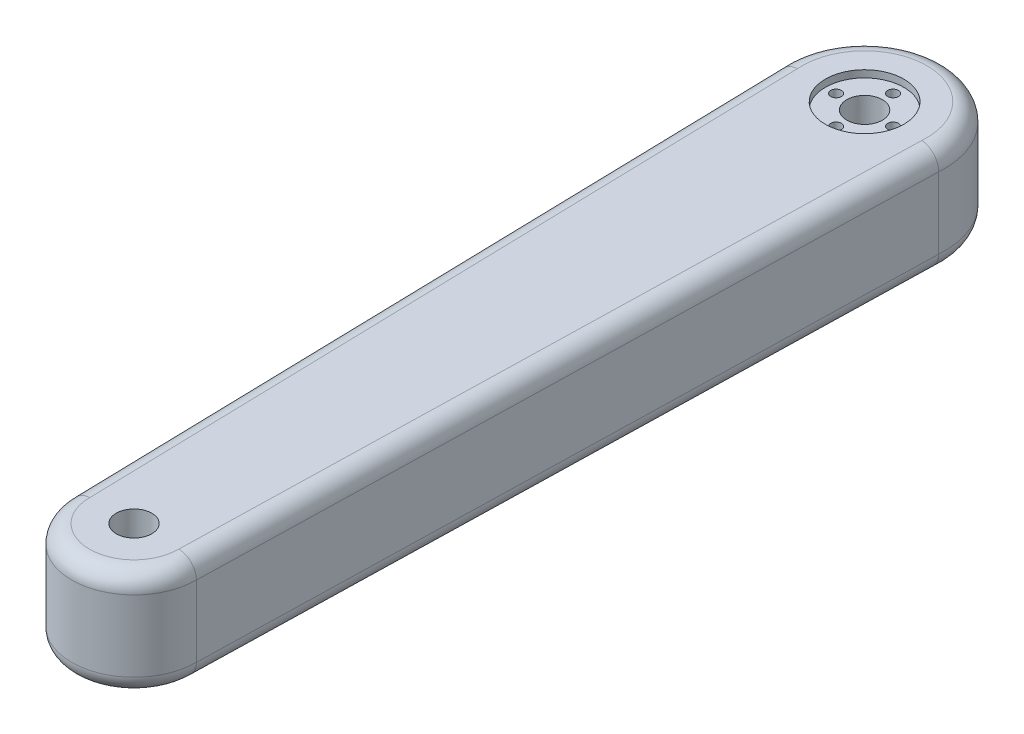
ISO-10303-21;
HEADER;
FILE_DESCRIPTION(('STEP AP214'),'2;1');
FILE_NAME('part.step','',(''),(''),'','','');
FILE_SCHEMA(('AUTOMOTIVE_DESIGN { 1 0 10303 214 1 1 1 1 }'));
ENDSEC;
DATA;
#1=APPLICATION_CONTEXT('core data for automotive mechanical design processes');
#2=APPLICATION_PROTOCOL_DEFINITION('international standard','automotive_design',2000,#1);
#3=PRODUCT_CONTEXT('',#1,'mechanical');
#4=PRODUCT('Part','Part','',(#3));
#5=PRODUCT_RELATED_PRODUCT_CATEGORY('part','',(#4));
#6=PRODUCT_DEFINITION_FORMATION('','',#4);
#7=PRODUCT_DEFINITION_CONTEXT('part definition',#1,'design');
#8=PRODUCT_DEFINITION('design','',#6,#7);
#9=PRODUCT_DEFINITION_SHAPE('','',#8);
#10=(LENGTH_UNIT() NAMED_UNIT(*) SI_UNIT(.MILLI.,.METRE.));
#11=(NAMED_UNIT(*) PLANE_ANGLE_UNIT() SI_UNIT($,.RADIAN.));
#12=(NAMED_UNIT(*) SI_UNIT($,.STERADIAN.) SOLID_ANGLE_UNIT());
#13=UNCERTAINTY_MEASURE_WITH_UNIT(LENGTH_MEASURE(1.E-05),#10,'distance_accuracy_value','');
#14=(GEOMETRIC_REPRESENTATION_CONTEXT(3) GLOBAL_UNCERTAINTY_ASSIGNED_CONTEXT((#13)) GLOBAL_UNIT_ASSIGNED_CONTEXT((#10,
#11,#12)) REPRESENTATION_CONTEXT('',''));
#15=CARTESIAN_POINT('',(0.,0.,0.));
#16=DIRECTION('',(0.,0.,1.));
#17=DIRECTION('',(1.,0.,0.));
#18=AXIS2_PLACEMENT_3D('',#15,#16,#17);
#19=CARTESIAN_POINT('',(0.,3.,0.));
#20=DIRECTION('',(0.,-1.,0.));
#21=DIRECTION('',(0.,0.,-1.));
#22=AXIS2_PLACEMENT_3D('',#19,#20,#21);
#23=PLANE('',#22);
#24=CARTESIAN_POINT('',(0.,3.,0.));
#25=DIRECTION('',(0.,-1.,0.));
#26=DIRECTION('',(0.,0.,-1.));
#27=AXIS2_PLACEMENT_3D('',#24,#25,#26);
#28=CIRCLE('',#27,5.);
#29=CARTESIAN_POINT('',(0.,3.,-5.));
#30=VERTEX_POINT('',#29);
#31=EDGE_CURVE('E270',#30,#30,#28,.T.);
#32=ORIENTED_EDGE('',*,*,#31,.F.);
#33=EDGE_LOOP('',(#32));
#34=FACE_BOUND('',#33,.T.);
#35=CARTESIAN_POINT('',(0.,3.,0.));
#36=DIRECTION('',(0.,-1.,0.));
#37=DIRECTION('',(0.,0.,-1.));
#38=AXIS2_PLACEMENT_3D('',#35,#36,#37);
#39=CIRCLE('',#38,6.5);
#40=CARTESIAN_POINT('',(0.,3.,-6.5));
#41=VERTEX_POINT('',#40);
#42=EDGE_CURVE('E394',#41,#41,#39,.F.);
#43=ORIENTED_EDGE('',*,*,#42,.F.);
#44=EDGE_LOOP('',(#43));
#45=FACE_BOUND('',#44,.T.);
#46=ADVANCED_FACE('F46',(#34,#45),#23,.T.);
#47=CARTESIAN_POINT('',(0.,30.,0.));
#48=DIRECTION('',(0.,-1.,0.));
#49=DIRECTION('',(0.,0.,-1.));
#50=AXIS2_PLACEMENT_3D('',#47,#48,#49);
#51=CYLINDRICAL_SURFACE('',#50,22.5);
#52=DIRECTION('',(0.,-1.,0.));
#53=VECTOR('',#52,1.);
#54=CARTESIAN_POINT('',(22.4398485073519,30.,1.64414079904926));
#55=LINE('',#54,#53);
#56=CARTESIAN_POINT('',(22.4398485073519,25.,1.64414079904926));
#57=VERTEX_POINT('',#56);
#58=CARTESIAN_POINT('',(22.4398485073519,5.,1.64414079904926));
#59=VERTEX_POINT('',#58);
#60=EDGE_CURVE('E202',#57,#59,#55,.T.);
#61=ORIENTED_EDGE('',*,*,#60,.T.);
#62=CARTESIAN_POINT('',(0.,5.,0.));
#63=DIRECTION('',(0.,1.,0.));
#64=DIRECTION('',(0.,0.,1.));
#65=AXIS2_PLACEMENT_3D('',#62,#63,#64);
#66=CIRCLE('',#65,22.5);
#67=CARTESIAN_POINT('',(-22.4398485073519,5.,1.64414079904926));
#68=VERTEX_POINT('',#67);
#69=EDGE_CURVE('E227',#59,#68,#66,.T.);
#70=ORIENTED_EDGE('',*,*,#69,.T.);
#71=DIRECTION('',(0.,-1.,0.));
#72=VECTOR('',#71,1.);
#73=CARTESIAN_POINT('',(-22.4398485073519,30.,1.64414079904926));
#74=LINE('',#73,#72);
#75=CARTESIAN_POINT('',(-22.4398485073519,25.,1.64414079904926));
#76=VERTEX_POINT('',#75);
#77=EDGE_CURVE('E142',#76,#68,#74,.T.);
#78=ORIENTED_EDGE('',*,*,#77,.F.);
#79=CARTESIAN_POINT('',(0.,25.,0.));
#80=DIRECTION('',(0.,1.,0.));
#81=DIRECTION('',(0.,0.,1.));
#82=AXIS2_PLACEMENT_3D('',#79,#80,#81);
#83=CIRCLE('',#82,22.5);
#84=EDGE_CURVE('E163',#76,#57,#83,.F.);
#85=ORIENTED_EDGE('',*,*,#84,.T.);
#86=EDGE_LOOP('',(#61,#70,#78,#85));
#87=FACE_BOUND('',#86,.T.);
#88=ADVANCED_FACE('F573',(#87),#51,.T.);
#89=CARTESIAN_POINT('',(-17.5,30.,205.));
#90=DIRECTION('',(0.999705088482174,0.,-0.0242844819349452));
#91=DIRECTION('',(-0.0242844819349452,0.,-0.999705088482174));
#92=AXIS2_PLACEMENT_3D('',#89,#90,#91);
#93=PLANE('',#92);
#94=ORIENTED_EDGE('',*,*,#77,.T.);
#95=DIRECTION('',(0.0242844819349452,0.,0.999705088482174));
#96=VECTOR('',#95,1.);
#97=CARTESIAN_POINT('',(-17.5,5.,205.));
#98=LINE('',#97,#96);
#99=CARTESIAN_POINT('',(-17.5,5.,205.));
#100=VERTEX_POINT('',#99);
#101=EDGE_CURVE('E165',#68,#100,#98,.T.);
#102=ORIENTED_EDGE('',*,*,#101,.T.);
#103=DIRECTION('',(0.,-1.,0.));
#104=VECTOR('',#103,1.);
#105=CARTESIAN_POINT('',(-17.5,30.,205.));
#106=LINE('',#105,#104);
#107=CARTESIAN_POINT('',(-17.5,25.,205.));
#108=VERTEX_POINT('',#107);
#109=EDGE_CURVE('E378',#108,#100,#106,.T.);
#110=ORIENTED_EDGE('',*,*,#109,.F.);
#111=DIRECTION('',(0.0242844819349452,0.,0.999705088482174));
#112=VECTOR('',#111,1.);
#113=CARTESIAN_POINT('',(-22.4398485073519,25.,1.64414079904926));
#114=LINE('',#113,#112);
#115=EDGE_CURVE('E160',#108,#76,#114,.F.);
#116=ORIENTED_EDGE('',*,*,#115,.T.);
#117=EDGE_LOOP('',(#94,#102,#110,#116));
#118=FACE_BOUND('',#117,.T.);
#119=ADVANCED_FACE('F595',(#118),#93,.F.);
#120=CARTESIAN_POINT('',(0.,30.,205.));
#121=DIRECTION('',(0.,-1.,0.));
#122=DIRECTION('',(0.,0.,-1.));
#123=AXIS2_PLACEMENT_3D('',#120,#121,#122);
#124=CYLINDRICAL_SURFACE('',#123,17.5);
#125=ORIENTED_EDGE('',*,*,#109,.T.);
#126=CARTESIAN_POINT('',(0.,5.,205.));
#127=DIRECTION('',(0.,1.,0.));
#128=DIRECTION('',(0.,0.,1.));
#129=AXIS2_PLACEMENT_3D('',#126,#127,#128);
#130=CIRCLE('',#129,17.5);
#131=CARTESIAN_POINT('',(17.5,5.,205.));
#132=VERTEX_POINT('',#131);
#133=EDGE_CURVE('E74',#100,#132,#130,.T.);
#134=ORIENTED_EDGE('',*,*,#133,.T.);
#135=DIRECTION('',(0.,-1.,0.));
#136=VECTOR('',#135,1.);
#137=CARTESIAN_POINT('',(17.5,30.,205.));
#138=LINE('',#137,#136);
#139=CARTESIAN_POINT('',(17.5,25.,205.));
#140=VERTEX_POINT('',#139);
#141=EDGE_CURVE('E375',#140,#132,#138,.T.);
#142=ORIENTED_EDGE('',*,*,#141,.F.);
#143=CARTESIAN_POINT('',(0.,25.,205.));
#144=DIRECTION('',(0.,1.,0.));
#145=DIRECTION('',(0.,0.,1.));
#146=AXIS2_PLACEMENT_3D('',#143,#144,#145);
#147=CIRCLE('',#146,17.5);
#148=EDGE_CURVE('E153',#140,#108,#147,.F.);
#149=ORIENTED_EDGE('',*,*,#148,.T.);
#150=EDGE_LOOP('',(#125,#134,#142,#149));
#151=FACE_BOUND('',#150,.T.);
#152=ADVANCED_FACE('F592',(#151),#124,.T.);
#153=CARTESIAN_POINT('',(17.5,30.,205.));
#154=DIRECTION('',(-0.999705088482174,0.,-0.0242844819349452));
#155=DIRECTION('',(-0.0242844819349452,0.,0.999705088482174));
#156=AXIS2_PLACEMENT_3D('',#153,#154,#155);
#157=PLANE('',#156);
#158=ORIENTED_EDGE('',*,*,#141,.T.);
#159=DIRECTION('',(0.0242844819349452,0.,-0.999705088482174));
#160=VECTOR('',#159,1.);
#161=CARTESIAN_POINT('',(17.5,5.,205.));
#162=LINE('',#161,#160);
#163=EDGE_CURVE('E66',#132,#59,#162,.T.);
#164=ORIENTED_EDGE('',*,*,#163,.T.);
#165=ORIENTED_EDGE('',*,*,#60,.F.);
#166=DIRECTION('',(0.0242844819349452,0.,-0.999705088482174));
#167=VECTOR('',#166,1.);
#168=CARTESIAN_POINT('',(17.5,25.,205.));
#169=LINE('',#168,#167);
#170=EDGE_CURVE('E126',#57,#140,#169,.F.);
#171=ORIENTED_EDGE('',*,*,#170,.T.);
#172=EDGE_LOOP('',(#158,#164,#165,#171));
#173=FACE_BOUND('',#172,.T.);
#174=ADVANCED_FACE('F585',(#173),#157,.F.);
#175=CARTESIAN_POINT('',(0.,30.,0.));
#176=DIRECTION('',(0.,1.,0.));
#177=DIRECTION('',(0.,0.,1.));
#178=AXIS2_PLACEMENT_3D('',#175,#176,#177);
#179=PLANE('',#178);
#180=CARTESIAN_POINT('',(0.,30.,0.));
#181=DIRECTION('',(0.,1.,0.));
#182=DIRECTION('',(0.,0.,1.));
#183=AXIS2_PLACEMENT_3D('',#180,#181,#182);
#184=CIRCLE('',#183,11.);
#185=CARTESIAN_POINT('',(0.,30.,11.));
#186=VERTEX_POINT('',#185);
#187=EDGE_CURVE('E274',#186,#186,#184,.T.);
#188=ORIENTED_EDGE('',*,*,#187,.F.);
#189=EDGE_LOOP('',(#188));
#190=FACE_BOUND('',#189,.T.);
#191=CARTESIAN_POINT('',(0.,30.,205.));
#192=DIRECTION('',(0.,1.,0.));
#193=DIRECTION('',(0.,0.,1.));
#194=AXIS2_PLACEMENT_3D('',#191,#192,#193);
#195=CIRCLE('',#194,12.5);
#196=CARTESIAN_POINT('',(-12.4998762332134,30.,204.944374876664));
#197=VERTEX_POINT('',#196);
#198=CARTESIAN_POINT('',(12.4998762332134,30.,204.944374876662));
#199=VERTEX_POINT('',#198);
#200=EDGE_CURVE('E147',#197,#199,#195,.T.);
#201=ORIENTED_EDGE('',*,*,#200,.T.);
#202=DIRECTION('',(0.0242844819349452,0.,-0.999705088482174));
#203=VECTOR('',#202,1.);
#204=CARTESIAN_POINT('',(17.441323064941,30.,1.52271838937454));
#205=LINE('',#204,#203);
#206=CARTESIAN_POINT('',(17.4444757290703,30.,1.3929345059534));
#207=VERTEX_POINT('',#206);
#208=EDGE_CURVE('E124',#199,#207,#205,.T.);
#209=ORIENTED_EDGE('',*,*,#208,.T.);
#210=CARTESIAN_POINT('',(0.,30.,0.));
#211=DIRECTION('',(0.,1.,0.));
#212=DIRECTION('',(0.,0.,1.));
#213=AXIS2_PLACEMENT_3D('',#210,#211,#212);
#214=CIRCLE('',#213,17.5);
#215=CARTESIAN_POINT('',(-17.4444757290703,30.,1.3929345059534));
#216=VERTEX_POINT('',#215);
#217=EDGE_CURVE('E134',#207,#216,#214,.T.);
#218=ORIENTED_EDGE('',*,*,#217,.T.);
#219=DIRECTION('',(0.0242844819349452,0.,0.999705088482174));
#220=VECTOR('',#219,1.);
#221=CARTESIAN_POINT('',(-12.5014745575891,30.,204.878577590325));
#222=LINE('',#221,#220);
#223=EDGE_CURVE('E141',#216,#197,#222,.T.);
#224=ORIENTED_EDGE('',*,*,#223,.T.);
#225=EDGE_LOOP('',(#201,#209,#218,#224));
#226=FACE_BOUND('',#225,.T.);
#227=CARTESIAN_POINT('',(0.,30.,205.));
#228=DIRECTION('',(0.,1.,0.));
#229=DIRECTION('',(0.,0.,1.));
#230=AXIS2_PLACEMENT_3D('',#227,#228,#229);
#231=CIRCLE('',#230,5.00000000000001);
#232=CARTESIAN_POINT('',(0.,30.,210.));
#233=VERTEX_POINT('',#232);
#234=EDGE_CURVE('E316',#233,#233,#231,.T.);
#235=ORIENTED_EDGE('',*,*,#234,.F.);
#236=EDGE_LOOP('',(#235));
#237=FACE_BOUND('',#236,.T.);
#238=ADVANCED_FACE('F144',(#190,#226,#237),#179,.T.);
#239=CARTESIAN_POINT('',(0.,0.,0.));
#240=DIRECTION('',(0.,1.,0.));
#241=DIRECTION('',(0.,0.,1.));
#242=AXIS2_PLACEMENT_3D('',#239,#240,#241);
#243=PLANE('',#242);
#244=CARTESIAN_POINT('',(0.,0.,0.));
#245=DIRECTION('',(0.,-1.,0.));
#246=DIRECTION('',(0.,0.,-1.));
#247=AXIS2_PLACEMENT_3D('',#244,#245,#246);
#248=CIRCLE('',#247,6.5);
#249=CARTESIAN_POINT('',(0.,0.,-6.5));
#250=VERTEX_POINT('',#249);
#251=EDGE_CURVE('E398',#250,#250,#248,.T.);
#252=ORIENTED_EDGE('',*,*,#251,.F.);
#253=EDGE_LOOP('',(#252));
#254=FACE_BOUND('',#253,.T.);
#255=CARTESIAN_POINT('',(0.,0.,205.));
#256=DIRECTION('',(0.,1.,0.));
#257=DIRECTION('',(0.,0.,1.));
#258=AXIS2_PLACEMENT_3D('',#255,#256,#257);
#259=CIRCLE('',#258,5.);
#260=CARTESIAN_POINT('',(0.,0.,210.));
#261=VERTEX_POINT('',#260);
#262=EDGE_CURVE('E276',#261,#261,#259,.T.);
#263=ORIENTED_EDGE('',*,*,#262,.T.);
#264=EDGE_LOOP('',(#263));
#265=FACE_BOUND('',#264,.T.);
#266=CARTESIAN_POINT('',(0.,0.,205.));
#267=DIRECTION('',(0.,1.,0.));
#268=DIRECTION('',(0.,0.,1.));
#269=AXIS2_PLACEMENT_3D('',#266,#267,#268);
#270=CIRCLE('',#269,12.5);
#271=CARTESIAN_POINT('',(12.4998762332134,0.,204.944374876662));
#272=VERTEX_POINT('',#271);
#273=CARTESIAN_POINT('',(-12.4998762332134,0.,204.944374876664));
#274=VERTEX_POINT('',#273);
#275=EDGE_CURVE('E216',#272,#274,#270,.F.);
#276=ORIENTED_EDGE('',*,*,#275,.T.);
#277=DIRECTION('',(0.0242844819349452,0.,0.999705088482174));
#278=VECTOR('',#277,1.);
#279=CARTESIAN_POINT('',(-17.4680048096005,0.,0.424326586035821));
#280=LINE('',#279,#278);
#281=CARTESIAN_POINT('',(-17.4444757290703,0.,1.39293450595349));
#282=VERTEX_POINT('',#281);
#283=EDGE_CURVE('E219',#274,#282,#280,.F.);
#284=ORIENTED_EDGE('',*,*,#283,.T.);
#285=CARTESIAN_POINT('',(0.,0.,0.));
#286=DIRECTION('',(0.,1.,0.));
#287=DIRECTION('',(0.,0.,1.));
#288=AXIS2_PLACEMENT_3D('',#285,#286,#287);
#289=CIRCLE('',#288,17.5);
#290=CARTESIAN_POINT('',(17.4444757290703,0.,1.39293450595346));
#291=VERTEX_POINT('',#290);
#292=EDGE_CURVE('E210',#282,#291,#289,.F.);
#293=ORIENTED_EDGE('',*,*,#292,.T.);
#294=DIRECTION('',(0.0242844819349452,0.,-0.999705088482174));
#295=VECTOR('',#294,1.);
#296=CARTESIAN_POINT('',(17.4680048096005,0.,0.424326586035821));
#297=LINE('',#296,#295);
#298=EDGE_CURVE('E213',#291,#272,#297,.F.);
#299=ORIENTED_EDGE('',*,*,#298,.T.);
#300=EDGE_LOOP('',(#276,#284,#293,#299));
#301=FACE_BOUND('',#300,.T.);
#302=ADVANCED_FACE('F584',(#254,#265,#301),#243,.F.);
#303=CARTESIAN_POINT('',(-17.4680048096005,25.,0.424326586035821));
#304=DIRECTION('',(-0.0242844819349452,0.,-0.999705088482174));
#305=DIRECTION('',(-0.999705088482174,0.,0.0242844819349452));
#306=AXIS2_PLACEMENT_3D('',#303,#304,#305);
#307=CYLINDRICAL_SURFACE('',#306,5.);
#308=CARTESIAN_POINT('',(-22.4398485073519,25.,1.64414079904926));
#309=CARTESIAN_POINT('',(-22.4398636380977,25.1405940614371,1.64414141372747));
#310=CARTESIAN_POINT('',(-22.4339244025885,25.2811859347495,1.64385198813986));
#311=CARTESIAN_POINT('',(-22.4102464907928,25.5613636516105,1.64269750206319));
#312=CARTESIAN_POINT('',(-22.3925083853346,25.7009495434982,1.64183246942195));
#313=CARTESIAN_POINT('',(-22.3453584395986,25.9780308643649,1.63953201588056));
#314=CARTESIAN_POINT('',(-22.3159547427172,26.1155276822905,1.63809699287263));
#315=CARTESIAN_POINT('',(-22.2456879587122,26.3875522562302,1.63466529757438));
#316=CARTESIAN_POINT('',(-22.2048250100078,26.5220800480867,1.63266863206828));
#317=CARTESIAN_POINT('',(-22.1119153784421,26.787251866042,1.62812480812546));
#318=CARTESIAN_POINT('',(-22.0598653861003,26.9178947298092,1.62557748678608));
#319=CARTESIAN_POINT('',(-21.9449385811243,27.1743740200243,1.61994689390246));
#320=CARTESIAN_POINT('',(-21.8820577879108,27.3002086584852,1.61686342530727));
#321=CARTESIAN_POINT('',(-21.7459707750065,27.5460532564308,1.61018165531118));
#322=CARTESIAN_POINT('',(-21.6727706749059,27.666066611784,1.60658365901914));
#323=CARTESIAN_POINT('',(-21.5165106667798,27.899536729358,1.59889178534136));
#324=CARTESIAN_POINT('',(-21.4334473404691,28.0129911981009,1.5947977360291));
#325=CARTESIAN_POINT('',(-21.2580810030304,28.2324817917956,1.58613995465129));
#326=CARTESIAN_POINT('',(-21.1657788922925,28.3385186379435,1.58157626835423));
#327=CARTESIAN_POINT('',(-20.9725849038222,28.5424334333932,1.57200666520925));
#328=CARTESIAN_POINT('',(-20.8716930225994,28.6403113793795,1.56700074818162));
#329=CARTESIAN_POINT('',(-20.6619845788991,28.827260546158,1.55657475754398));
#330=CARTESIAN_POINT('',(-20.5531640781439,28.9163273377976,1.55115447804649));
#331=CARTESIAN_POINT('',(-20.3284566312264,29.084936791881,1.53993742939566));
#332=CARTESIAN_POINT('',(-20.2125721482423,29.1644827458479,1.53414079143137));
#333=CARTESIAN_POINT('',(-19.974418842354,29.3135895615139,1.52220007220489));
#334=CARTESIAN_POINT('',(-19.8521443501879,29.3831413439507,1.51605568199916));
#335=CARTESIAN_POINT('',(-19.6022242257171,29.5116566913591,1.50346531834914));
#336=CARTESIAN_POINT('',(-19.4745805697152,29.570624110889,1.49701945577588));
#337=CARTESIAN_POINT('',(-19.2148531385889,29.6775564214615,1.48386841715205));
#338=CARTESIAN_POINT('',(-19.0827716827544,29.7255269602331,1.47716337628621));
#339=CARTESIAN_POINT('',(-18.8150928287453,29.8101506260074,1.46353652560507));
#340=CARTESIAN_POINT('',(-18.6794964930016,29.8468071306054,1.45661478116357));
#341=CARTESIAN_POINT('',(-18.3722155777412,29.9161162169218,1.44088281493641));
#342=CARTESIAN_POINT('',(-18.1998118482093,29.9455996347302,1.43202456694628));
#343=CARTESIAN_POINT('',(-17.8531017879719,29.9862975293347,1.4141413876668));
#344=CARTESIAN_POINT('',(-17.678798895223,29.9975408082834,1.40511674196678));
#345=CARTESIAN_POINT('',(-17.4844897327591,29.9998798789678,1.39501598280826));
#346=CARTESIAN_POINT('',(-17.4644818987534,30.0000002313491,1.39397544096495));
#347=CARTESIAN_POINT('',(-17.4444757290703,30.,1.39293450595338));
#348=B_SPLINE_CURVE_WITH_KNOTS('',3,(#308,#309,#310,#311,#312,#313,#314,#315,#316,#317,#318,
#319,#320,#321,#322,#323,#324,#325,#326,#327,#328,#329,#330,#331,#332,#333,#334,#335,#336,#337,
#338,#339,#340,#341,#342,#343,#344,#345,#346,#347),.UNSPECIFIED.,.F.,.F.,(4,2,2,2,2,2,2,2,2,2,2,
2,2,2,2,2,2,2,2,4),(0.,0.421653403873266,0.843286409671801,1.26462560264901,1.68595970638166,
2.1074186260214,2.52903277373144,2.9503979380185,3.37190956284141,3.79338014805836,
4.21485090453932,4.63653245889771,5.05806780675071,5.47998371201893,5.90174565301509,
6.32329049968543,6.74470937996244,7.26914345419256,7.79274861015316,7.85285266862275),.UNSPECIFIED.);
#349=EDGE_CURVE('E137',#76,#216,#348,.T.);
#350=ORIENTED_EDGE('',*,*,#349,.F.);
#351=ORIENTED_EDGE('',*,*,#115,.F.);
#352=CARTESIAN_POINT('',(-17.5,25.,205.));
#353=CARTESIAN_POINT('',(-17.5000151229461,25.1406176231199,205.000000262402));
#354=CARTESIAN_POINT('',(-17.4940686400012,25.2812330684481,204.999927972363));
#355=CARTESIAN_POINT('',(-17.4703616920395,25.5614579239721,204.999640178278));
#356=CARTESIAN_POINT('',(-17.4526017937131,25.7010673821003,204.999424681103));
#357=CARTESIAN_POINT('',(-17.4053935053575,25.978196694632,204.998852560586));
#358=CARTESIAN_POINT('',(-17.3759531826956,26.1157179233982,204.99849603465));
#359=CARTESIAN_POINT('',(-17.3055983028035,26.3877909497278,204.997645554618));
#360=CARTESIAN_POINT('',(-17.2646838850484,26.5223427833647,204.997151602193));
#361=CARTESIAN_POINT('',(-17.1716562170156,26.7875624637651,204.996031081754));
#362=CARTESIAN_POINT('',(-17.1195396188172,26.9182291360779,204.995404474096));
#363=CARTESIAN_POINT('',(-17.0044644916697,27.1747549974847,204.994024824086));
#364=CARTESIAN_POINT('',(-16.9415019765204,27.3006123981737,204.99327173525));
#365=CARTESIAN_POINT('',(-16.8052367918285,27.5465003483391,204.991647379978));
#366=CARTESIAN_POINT('',(-16.7319402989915,27.6665343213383,204.990776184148));
#367=CARTESIAN_POINT('',(-16.5754725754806,27.9000434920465,204.988923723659));
#368=CARTESIAN_POINT('',(-16.4922979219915,28.0135163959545,204.987942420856));
#369=CARTESIAN_POINT('',(-16.3167028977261,28.2330300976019,204.985880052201));
#370=CARTESIAN_POINT('',(-16.2242843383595,28.3390723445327,204.984799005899));
#371=CARTESIAN_POINT('',(-16.0308448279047,28.5429957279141,204.982547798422));
#372=CARTESIAN_POINT('',(-15.9298238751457,28.6408768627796,204.98137763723));
#373=CARTESIAN_POINT('',(-15.7198435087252,28.8278307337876,204.978959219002));
#374=CARTESIAN_POINT('',(-15.6108800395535,28.9168989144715,204.977710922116));
#375=CARTESIAN_POINT('',(-15.3858749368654,29.0855069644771,204.97514957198));
#376=CARTESIAN_POINT('',(-15.2698357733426,29.1650501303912,204.973836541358));
#377=CARTESIAN_POINT('',(-15.0313848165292,29.3141320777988,204.971157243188));
#378=CARTESIAN_POINT('',(-14.9089685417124,29.3836636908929,204.969790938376));
#379=CARTESIAN_POINT('',(-14.6587571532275,29.5121367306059,204.967019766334));
#380=CARTESIAN_POINT('',(-14.5309640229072,29.5710820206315,204.965614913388));
#381=CARTESIAN_POINT('',(-14.2709388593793,29.6779642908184,204.962780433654));
#382=CARTESIAN_POINT('',(-14.1387094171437,29.7259075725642,204.961350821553));
#383=CARTESIAN_POINT('',(-13.8707297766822,29.8104746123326,204.958480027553));
#384=CARTESIAN_POINT('',(-13.7349806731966,29.8471018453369,204.957038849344));
#385=CARTESIAN_POINT('',(-13.4313688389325,29.9154392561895,204.953847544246));
#386=CARTESIAN_POINT('',(-13.2628811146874,29.9443956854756,204.952097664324));
#387=CARTESIAN_POINT('',(-12.9240450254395,29.9848922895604,204.948625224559));
#388=CARTESIAN_POINT('',(-12.7536998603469,29.996458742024,204.946902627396));
#389=CARTESIAN_POINT('',(-12.555493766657,29.9997683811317,204.944927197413));
#390=CARTESIAN_POINT('',(-12.5276835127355,30.0000004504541,204.944650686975));
#391=CARTESIAN_POINT('',(-12.4998762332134,30.,204.944374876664));
#392=B_SPLINE_CURVE_WITH_KNOTS('',3,(#352,#353,#354,#355,#356,#357,#358,#359,#360,#361,#362,
#363,#364,#365,#366,#367,#368,#369,#370,#371,#372,#373,#374,#375,#376,#377,#378,#379,#380,#381,
#382,#383,#384,#385,#386,#387,#388,#389,#390,#391),.UNSPECIFIED.,.F.,.F.,(4,2,2,2,2,2,2,2,2,2,2,
2,2,2,2,2,2,2,2,4),(0.,0.421724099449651,0.843427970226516,1.26484108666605,1.68624908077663,
2.10778319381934,2.52947256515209,2.95091094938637,3.37249579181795,3.79399818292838,
4.21550065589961,4.63721987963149,5.05879272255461,5.48066593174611,5.90238486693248,
6.32386164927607,6.74520887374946,7.25721683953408,7.7684503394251,7.85188376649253),.UNSPECIFIED.);
#393=EDGE_CURVE('E194',#197,#108,#392,.F.);
#394=ORIENTED_EDGE('',*,*,#393,.F.);
#395=ORIENTED_EDGE('',*,*,#223,.F.);
#396=EDGE_LOOP('',(#350,#351,#394,#395));
#397=FACE_BOUND('',#396,.T.);
#398=ADVANCED_FACE('F188',(#397),#307,.T.);
#399=CARTESIAN_POINT('',(0.,25.,205.));
#400=DIRECTION('',(0.,1.,0.));
#401=DIRECTION('',(0.,0.,1.));
#402=AXIS2_PLACEMENT_3D('',#399,#400,#401);
#403=TOROIDAL_SURFACE('',#402,12.5,5.);
#404=ORIENTED_EDGE('',*,*,#393,.T.);
#405=ORIENTED_EDGE('',*,*,#148,.F.);
#406=CARTESIAN_POINT('',(17.5,25.,205.));
#407=CARTESIAN_POINT('',(17.5000151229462,25.1406176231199,205.000000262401));
#408=CARTESIAN_POINT('',(17.4940686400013,25.2812330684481,204.999927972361));
#409=CARTESIAN_POINT('',(17.4703616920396,25.5614579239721,204.999640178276));
#410=CARTESIAN_POINT('',(17.4526017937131,25.7010673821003,204.999424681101));
#411=CARTESIAN_POINT('',(17.4053935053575,25.978196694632,204.998852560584));
#412=CARTESIAN_POINT('',(17.3759531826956,26.1157179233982,204.998496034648));
#413=CARTESIAN_POINT('',(17.3055983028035,26.3877909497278,204.997645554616));
#414=CARTESIAN_POINT('',(17.2646838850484,26.5223427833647,204.997151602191));
#415=CARTESIAN_POINT('',(17.1716562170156,26.7875624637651,204.996031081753));
#416=CARTESIAN_POINT('',(17.1195396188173,26.9182291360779,204.995404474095));
#417=CARTESIAN_POINT('',(17.0044644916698,27.1747549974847,204.994024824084));
#418=CARTESIAN_POINT('',(16.9415019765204,27.3006123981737,204.993271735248));
#419=CARTESIAN_POINT('',(16.8052367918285,27.5465003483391,204.991647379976));
#420=CARTESIAN_POINT('',(16.7319402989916,27.6665343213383,204.990776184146));
#421=CARTESIAN_POINT('',(16.5754725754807,27.9000434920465,204.988923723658));
#422=CARTESIAN_POINT('',(16.4922979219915,28.0135163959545,204.987942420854));
#423=CARTESIAN_POINT('',(16.3167028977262,28.2330300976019,204.985880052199));
#424=CARTESIAN_POINT('',(16.2242843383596,28.3390723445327,204.984799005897));
#425=CARTESIAN_POINT('',(16.0308448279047,28.5429957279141,204.98254779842));
#426=CARTESIAN_POINT('',(15.9298238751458,28.6408768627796,204.981377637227));
#427=CARTESIAN_POINT('',(15.7198435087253,28.8278307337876,204.978959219));
#428=CARTESIAN_POINT('',(15.6108800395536,28.9168989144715,204.977710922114));
#429=CARTESIAN_POINT('',(15.3858749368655,29.0855069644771,204.975149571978));
#430=CARTESIAN_POINT('',(15.2698357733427,29.1650501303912,204.973836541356));
#431=CARTESIAN_POINT('',(15.0313848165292,29.3141320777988,204.971157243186));
#432=CARTESIAN_POINT('',(14.9089685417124,29.3836636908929,204.969790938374));
#433=CARTESIAN_POINT('',(14.6587571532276,29.5121367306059,204.967019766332));
#434=CARTESIAN_POINT('',(14.5309640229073,29.5710820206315,204.965614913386));
#435=CARTESIAN_POINT('',(14.2709388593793,29.6779642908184,204.962780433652));
#436=CARTESIAN_POINT('',(14.1387094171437,29.7259075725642,204.961350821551));
#437=CARTESIAN_POINT('',(13.8707297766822,29.8104746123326,204.958480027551));
#438=CARTESIAN_POINT('',(13.7349806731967,29.8471018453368,204.957038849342));
#439=CARTESIAN_POINT('',(13.4313688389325,29.9154392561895,204.953847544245));
#440=CARTESIAN_POINT('',(13.2628811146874,29.9443956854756,204.952097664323));
#441=CARTESIAN_POINT('',(12.9240450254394,29.9848922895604,204.948625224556));
#442=CARTESIAN_POINT('',(12.7536998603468,29.996458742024,204.94690262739));
#443=CARTESIAN_POINT('',(12.5554937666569,29.9997683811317,204.94492719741));
#444=CARTESIAN_POINT('',(12.5276835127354,30.0000004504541,204.944650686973));
#445=CARTESIAN_POINT('',(12.4998762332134,30.,204.944374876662));
#446=B_SPLINE_CURVE_WITH_KNOTS('',3,(#406,#407,#408,#409,#410,#411,#412,#413,#414,#415,#416,
#417,#418,#419,#420,#421,#422,#423,#424,#425,#426,#427,#428,#429,#430,#431,#432,#433,#434,#435,
#436,#437,#438,#439,#440,#441,#442,#443,#444,#445),.UNSPECIFIED.,.F.,.F.,(4,2,2,2,2,2,2,2,2,2,2,
2,2,2,2,2,2,2,2,4),(0.,0.421724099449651,0.843427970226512,1.26484108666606,1.68624908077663,
2.10778319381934,2.52947256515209,2.95091094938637,3.37249579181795,3.79399818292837,
4.2155006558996,4.63721987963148,5.05879272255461,5.48066593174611,5.90238486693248,
6.32386164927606,6.74520887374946,7.25721683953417,7.7684503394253,7.85188376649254),.UNSPECIFIED.);
#447=EDGE_CURVE('E130',#199,#140,#446,.F.);
#448=ORIENTED_EDGE('',*,*,#447,.F.);
#449=ORIENTED_EDGE('',*,*,#200,.F.);
#450=EDGE_LOOP('',(#404,#405,#448,#449));
#451=FACE_BOUND('',#450,.T.);
#452=ADVANCED_FACE('F183',(#451),#403,.T.);
#453=CARTESIAN_POINT('',(0.,25.,0.));
#454=DIRECTION('',(0.,1.,0.));
#455=DIRECTION('',(0.,0.,1.));
#456=AXIS2_PLACEMENT_3D('',#453,#454,#455);
#457=TOROIDAL_SURFACE('',#456,17.5,5.);
#458=ORIENTED_EDGE('',*,*,#349,.T.);
#459=ORIENTED_EDGE('',*,*,#217,.F.);
#460=CARTESIAN_POINT('',(22.4398485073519,25.,1.64414079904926));
#461=CARTESIAN_POINT('',(22.4398636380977,25.1405940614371,1.64414141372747));
#462=CARTESIAN_POINT('',(22.4339244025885,25.2811859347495,1.64385198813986));
#463=CARTESIAN_POINT('',(22.4102464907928,25.5613636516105,1.64269750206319));
#464=CARTESIAN_POINT('',(22.3925083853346,25.7009495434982,1.64183246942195));
#465=CARTESIAN_POINT('',(22.3453584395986,25.9780308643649,1.63953201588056));
#466=CARTESIAN_POINT('',(22.3159547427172,26.1155276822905,1.63809699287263));
#467=CARTESIAN_POINT('',(22.2456879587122,26.3875522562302,1.63466529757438));
#468=CARTESIAN_POINT('',(22.2048250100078,26.5220800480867,1.63266863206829));
#469=CARTESIAN_POINT('',(22.1119153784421,26.787251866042,1.62812480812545));
#470=CARTESIAN_POINT('',(22.0598653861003,26.9178947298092,1.62557748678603));
#471=CARTESIAN_POINT('',(21.9449385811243,27.1743740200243,1.6199468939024));
#472=CARTESIAN_POINT('',(21.8820577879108,27.3002086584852,1.61686342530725));
#473=CARTESIAN_POINT('',(21.7459707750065,27.5460532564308,1.6101816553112));
#474=CARTESIAN_POINT('',(21.6727706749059,27.666066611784,1.60658365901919));
#475=CARTESIAN_POINT('',(21.5165106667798,27.899536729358,1.5988917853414));
#476=CARTESIAN_POINT('',(21.4334473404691,28.0129911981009,1.59479773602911));
#477=CARTESIAN_POINT('',(21.2580810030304,28.2324817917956,1.58613995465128));
#478=CARTESIAN_POINT('',(21.1657788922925,28.3385186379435,1.58157626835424));
#479=CARTESIAN_POINT('',(20.9725849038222,28.5424334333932,1.57200666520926));
#480=CARTESIAN_POINT('',(20.8716930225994,28.6403113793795,1.56700074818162));
#481=CARTESIAN_POINT('',(20.6619845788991,28.827260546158,1.55657475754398));
#482=CARTESIAN_POINT('',(20.5531640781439,28.9163273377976,1.55115447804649));
#483=CARTESIAN_POINT('',(20.3284566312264,29.084936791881,1.53993742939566));
#484=CARTESIAN_POINT('',(20.2125721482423,29.1644827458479,1.53414079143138));
#485=CARTESIAN_POINT('',(19.974418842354,29.3135895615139,1.52220007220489));
#486=CARTESIAN_POINT('',(19.8521443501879,29.3831413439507,1.51605568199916));
#487=CARTESIAN_POINT('',(19.6022242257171,29.5116566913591,1.50346531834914));
#488=CARTESIAN_POINT('',(19.4745805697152,29.570624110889,1.49701945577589));
#489=CARTESIAN_POINT('',(19.2148531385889,29.6775564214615,1.48386841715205));
#490=CARTESIAN_POINT('',(19.0827716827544,29.7255269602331,1.47716337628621));
#491=CARTESIAN_POINT('',(18.8150928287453,29.8101506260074,1.46353652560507));
#492=CARTESIAN_POINT('',(18.6794964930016,29.8468071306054,1.45661478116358));
#493=CARTESIAN_POINT('',(18.3722155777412,29.9161162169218,1.4408828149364));
#494=CARTESIAN_POINT('',(18.1998118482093,29.9455996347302,1.43202456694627));
#495=CARTESIAN_POINT('',(17.8531017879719,29.9862975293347,1.41414138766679));
#496=CARTESIAN_POINT('',(17.678798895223,29.9975408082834,1.40511674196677));
#497=CARTESIAN_POINT('',(17.4844897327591,29.9998798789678,1.39501598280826));
#498=CARTESIAN_POINT('',(17.4644818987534,30.0000002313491,1.39397544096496));
#499=CARTESIAN_POINT('',(17.4444757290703,30.,1.39293450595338));
#500=B_SPLINE_CURVE_WITH_KNOTS('',3,(#460,#461,#462,#463,#464,#465,#466,#467,#468,#469,#470,
#471,#472,#473,#474,#475,#476,#477,#478,#479,#480,#481,#482,#483,#484,#485,#486,#487,#488,#489,
#490,#491,#492,#493,#494,#495,#496,#497,#498,#499),.UNSPECIFIED.,.F.,.F.,(4,2,2,2,2,2,2,2,2,2,2,
2,2,2,2,2,2,2,2,4),(0.,0.421653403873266,0.843286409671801,1.26462560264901,1.68595970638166,
2.1074186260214,2.52903277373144,2.9503979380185,3.37190956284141,3.79338014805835,
4.21485090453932,4.63653245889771,5.05806780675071,5.47998371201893,5.90174565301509,
6.32329049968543,6.74470937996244,7.26914345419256,7.79274861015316,7.85285266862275),.UNSPECIFIED.);
#501=EDGE_CURVE('E120',#57,#207,#500,.T.);
#502=ORIENTED_EDGE('',*,*,#501,.F.);
#503=ORIENTED_EDGE('',*,*,#84,.F.);
#504=EDGE_LOOP('',(#458,#459,#502,#503));
#505=FACE_BOUND('',#504,.T.);
#506=ADVANCED_FACE('F135',(#505),#457,.T.);
#507=CARTESIAN_POINT('',(17.4680048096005,25.,0.424326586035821));
#508=DIRECTION('',(-0.0242844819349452,0.,0.999705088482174));
#509=DIRECTION('',(0.999705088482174,0.,0.0242844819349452));
#510=AXIS2_PLACEMENT_3D('',#507,#508,#509);
#511=CYLINDRICAL_SURFACE('',#510,5.);
#512=ORIENTED_EDGE('',*,*,#447,.T.);
#513=ORIENTED_EDGE('',*,*,#170,.F.);
#514=ORIENTED_EDGE('',*,*,#501,.T.);
#515=ORIENTED_EDGE('',*,*,#208,.F.);
#516=EDGE_LOOP('',(#512,#513,#514,#515));
#517=FACE_BOUND('',#516,.T.);
#518=ADVANCED_FACE('F122',(#517),#511,.T.);
#519=CARTESIAN_POINT('',(12.5014745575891,5.,204.878577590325));
#520=DIRECTION('',(0.0242844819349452,0.,-0.999705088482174));
#521=DIRECTION('',(-0.999705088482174,0.,-0.0242844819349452));
#522=AXIS2_PLACEMENT_3D('',#519,#520,#521);
#523=CYLINDRICAL_SURFACE('',#522,5.);
#524=CARTESIAN_POINT('',(17.5,5.,205.));
#525=CARTESIAN_POINT('',(17.5000151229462,4.85938237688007,205.000000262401));
#526=CARTESIAN_POINT('',(17.4940686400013,4.71876693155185,204.999927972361));
#527=CARTESIAN_POINT('',(17.4703616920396,4.43854207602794,204.999640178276));
#528=CARTESIAN_POINT('',(17.4526017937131,4.29893261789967,204.999424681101));
#529=CARTESIAN_POINT('',(17.4053935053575,4.02180330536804,204.998852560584));
#530=CARTESIAN_POINT('',(17.3759531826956,3.88428207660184,204.998496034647));
#531=CARTESIAN_POINT('',(17.3055983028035,3.61220905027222,204.997645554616));
#532=CARTESIAN_POINT('',(17.2646838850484,3.47765721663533,204.997151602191));
#533=CARTESIAN_POINT('',(17.1716562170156,3.21243753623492,204.996031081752));
#534=CARTESIAN_POINT('',(17.1195396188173,3.08177086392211,204.995404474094));
#535=CARTESIAN_POINT('',(17.0044644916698,2.82524500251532,204.994024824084));
#536=CARTESIAN_POINT('',(16.9415019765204,2.69938760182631,204.993271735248));
#537=CARTESIAN_POINT('',(16.8052367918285,2.45349965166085,204.991647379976));
#538=CARTESIAN_POINT('',(16.7319402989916,2.3334656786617,204.990776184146));
#539=CARTESIAN_POINT('',(16.5754725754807,2.09995650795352,204.988923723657));
#540=CARTESIAN_POINT('',(16.4922979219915,1.98648360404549,204.987942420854));
#541=CARTESIAN_POINT('',(16.3167028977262,1.76696990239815,204.985880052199));
#542=CARTESIAN_POINT('',(16.2242843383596,1.66092765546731,204.984799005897));
#543=CARTESIAN_POINT('',(16.0308448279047,1.45700427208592,204.98254779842));
#544=CARTESIAN_POINT('',(15.9298238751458,1.35912313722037,204.981377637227));
#545=CARTESIAN_POINT('',(15.7198435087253,1.17216926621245,204.978959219));
#546=CARTESIAN_POINT('',(15.6108800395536,1.08310108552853,204.977710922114));
#547=CARTESIAN_POINT('',(15.3858749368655,0.914493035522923,204.975149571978));
#548=CARTESIAN_POINT('',(15.2698357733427,0.83494986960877,204.973836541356));
#549=CARTESIAN_POINT('',(15.0313848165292,0.685867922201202,204.971157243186));
#550=CARTESIAN_POINT('',(14.9089685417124,0.616336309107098,204.969790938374));
#551=CARTESIAN_POINT('',(14.6587571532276,0.487863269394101,204.967019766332));
#552=CARTESIAN_POINT('',(14.5309640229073,0.428917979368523,204.965614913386));
#553=CARTESIAN_POINT('',(14.2709388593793,0.322035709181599,204.962780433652));
#554=CARTESIAN_POINT('',(14.1387094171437,0.274092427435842,204.961350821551));
#555=CARTESIAN_POINT('',(13.8707297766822,0.189525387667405,204.958480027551));
#556=CARTESIAN_POINT('',(13.7349806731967,0.152898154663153,204.957038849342));
#557=CARTESIAN_POINT('',(13.4313688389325,0.0845607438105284,204.953847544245));
#558=CARTESIAN_POINT('',(13.2628811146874,0.0556043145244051,204.952097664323));
#559=CARTESIAN_POINT('',(12.9240450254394,0.0151077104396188,204.948625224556));
#560=CARTESIAN_POINT('',(12.7536998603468,0.00354125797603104,204.94690262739));
#561=CARTESIAN_POINT('',(12.5554937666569,0.000231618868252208,204.94492719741));
#562=CARTESIAN_POINT('',(12.5276835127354,-4.50454077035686E-07,204.944650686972));
#563=CARTESIAN_POINT('',(12.4998762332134,0.,204.944374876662));
#564=B_SPLINE_CURVE_WITH_KNOTS('',3,(#524,#525,#526,#527,#528,#529,#530,#531,#532,#533,#534,
#535,#536,#537,#538,#539,#540,#541,#542,#543,#544,#545,#546,#547,#548,#549,#550,#551,#552,#553,
#554,#555,#556,#557,#558,#559,#560,#561,#562,#563),.UNSPECIFIED.,.F.,.F.,(4,2,2,2,2,2,2,2,2,2,2,
2,2,2,2,2,2,2,2,4),(0.,0.421724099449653,0.843427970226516,1.26484108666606,1.68624908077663,
2.10778319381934,2.52947256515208,2.95091094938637,3.37249579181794,3.79399818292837,
4.2155006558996,4.63721987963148,5.0587927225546,5.4806659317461,5.90238486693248,
6.32386164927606,6.74520887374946,7.25721683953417,7.7684503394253,7.85188376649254),.UNSPECIFIED.);
#565=EDGE_CURVE('E255',#272,#132,#564,.F.);
#566=ORIENTED_EDGE('',*,*,#565,.F.);
#567=ORIENTED_EDGE('',*,*,#298,.F.);
#568=CARTESIAN_POINT('',(22.4398485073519,5.,1.64414079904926));
#569=CARTESIAN_POINT('',(22.4398636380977,4.85940593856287,1.64414141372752));
#570=CARTESIAN_POINT('',(22.4339244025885,4.71881406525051,1.64385198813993));
#571=CARTESIAN_POINT('',(22.4102464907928,4.43863634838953,1.64269750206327));
#572=CARTESIAN_POINT('',(22.3925083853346,4.29905045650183,1.64183246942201));
#573=CARTESIAN_POINT('',(22.3453584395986,4.02196913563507,1.63953201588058));
#574=CARTESIAN_POINT('',(22.3159547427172,3.88447231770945,1.63809699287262));
#575=CARTESIAN_POINT('',(22.2456879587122,3.61244774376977,1.6346652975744));
#576=CARTESIAN_POINT('',(22.2048250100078,3.47791995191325,1.63266863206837));
#577=CARTESIAN_POINT('',(22.1119153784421,3.21274813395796,1.62812480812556));
#578=CARTESIAN_POINT('',(22.0598653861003,3.08210527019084,1.62557748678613));
#579=CARTESIAN_POINT('',(21.9449385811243,2.82562597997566,1.61994689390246));
#580=CARTESIAN_POINT('',(21.8820577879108,2.69979134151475,1.61686342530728));
#581=CARTESIAN_POINT('',(21.7459707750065,2.45394674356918,1.61018165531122));
#582=CARTESIAN_POINT('',(21.6727706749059,2.33393338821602,1.60658365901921));
#583=CARTESIAN_POINT('',(21.5165106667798,2.10046327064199,1.59889178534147));
#584=CARTESIAN_POINT('',(21.4334473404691,1.98700880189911,1.59479773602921));
#585=CARTESIAN_POINT('',(21.2580810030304,1.76751820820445,1.58613995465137));
#586=CARTESIAN_POINT('',(21.1657788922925,1.66148136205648,1.58157626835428));
#587=CARTESIAN_POINT('',(20.9725849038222,1.45756656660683,1.57200666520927));
#588=CARTESIAN_POINT('',(20.8716930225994,1.35968862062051,1.56700074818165));
#589=CARTESIAN_POINT('',(20.6619845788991,1.17273945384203,1.55657475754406));
#590=CARTESIAN_POINT('',(20.5531640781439,1.08367266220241,1.5511544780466));
#591=CARTESIAN_POINT('',(20.3284566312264,0.915063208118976,1.5399374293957));
#592=CARTESIAN_POINT('',(20.2125721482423,0.835517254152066,1.53414079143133));
#593=CARTESIAN_POINT('',(19.974418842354,0.686410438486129,1.52220007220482));
#594=CARTESIAN_POINT('',(19.8521443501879,0.616858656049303,1.51605568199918));
#595=CARTESIAN_POINT('',(19.6022242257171,0.488343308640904,1.50346531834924));
#596=CARTESIAN_POINT('',(19.4745805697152,0.429375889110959,1.49701945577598));
#597=CARTESIAN_POINT('',(19.2148531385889,0.322443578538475,1.48386841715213));
#598=CARTESIAN_POINT('',(19.0827716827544,0.274473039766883,1.47716337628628));
#599=CARTESIAN_POINT('',(18.8150928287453,0.189849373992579,1.4635365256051));
#600=CARTESIAN_POINT('',(18.6794964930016,0.153192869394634,1.45661478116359));
#601=CARTESIAN_POINT('',(18.3722155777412,0.0838837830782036,1.44088281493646));
#602=CARTESIAN_POINT('',(18.1998118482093,0.0544003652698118,1.43202456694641));
#603=CARTESIAN_POINT('',(17.8531017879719,0.0137024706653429,1.4141413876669));
#604=CARTESIAN_POINT('',(17.678798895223,0.00245919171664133,1.40511674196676));
#605=CARTESIAN_POINT('',(17.4844897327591,0.000120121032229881,1.3950159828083));
#606=CARTESIAN_POINT('',(17.4644818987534,-2.31349101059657E-07,1.393975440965));
#607=CARTESIAN_POINT('',(17.4444757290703,0.,1.39293450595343));
#608=B_SPLINE_CURVE_WITH_KNOTS('',3,(#568,#569,#570,#571,#572,#573,#574,#575,#576,#577,#578,
#579,#580,#581,#582,#583,#584,#585,#586,#587,#588,#589,#590,#591,#592,#593,#594,#595,#596,#597,
#598,#599,#600,#601,#602,#603,#604,#605,#606,#607),.UNSPECIFIED.,.F.,.F.,(4,2,2,2,2,2,2,2,2,2,2,
2,2,2,2,2,2,2,2,4),(0.,0.421653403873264,0.843286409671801,1.26462560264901,1.68595970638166,
2.1074186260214,2.52903277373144,2.95039793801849,3.37190956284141,3.79338014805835,
4.21485090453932,4.6365324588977,5.05806780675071,5.47998371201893,5.90174565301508,
6.32329049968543,6.74470937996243,7.26914345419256,7.79274861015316,7.85285266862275),.UNSPECIFIED.);
#609=EDGE_CURVE('E131',#59,#291,#608,.T.);
#610=ORIENTED_EDGE('',*,*,#609,.F.);
#611=ORIENTED_EDGE('',*,*,#163,.F.);
#612=EDGE_LOOP('',(#566,#567,#610,#611));
#613=FACE_BOUND('',#612,.T.);
#614=ADVANCED_FACE('F48',(#613),#523,.T.);
#615=CARTESIAN_POINT('',(0.,5.,0.));
#616=DIRECTION('',(0.,1.,0.));
#617=DIRECTION('',(0.,0.,1.));
#618=AXIS2_PLACEMENT_3D('',#615,#616,#617);
#619=TOROIDAL_SURFACE('',#618,17.5,5.);
#620=ORIENTED_EDGE('',*,*,#609,.T.);
#621=ORIENTED_EDGE('',*,*,#292,.F.);
#622=CARTESIAN_POINT('',(-22.4398485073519,5.,1.64414079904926));
#623=CARTESIAN_POINT('',(-22.4398636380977,4.85940593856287,1.64414141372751));
#624=CARTESIAN_POINT('',(-22.4339244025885,4.71881406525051,1.64385198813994));
#625=CARTESIAN_POINT('',(-22.4102464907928,4.43863634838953,1.6426975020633));
#626=CARTESIAN_POINT('',(-22.3925083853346,4.29905045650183,1.64183246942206));
#627=CARTESIAN_POINT('',(-22.3453584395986,4.02196913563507,1.63953201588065));
#628=CARTESIAN_POINT('',(-22.3159547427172,3.88447231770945,1.63809699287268));
#629=CARTESIAN_POINT('',(-22.2456879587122,3.61244774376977,1.63466529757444));
#630=CARTESIAN_POINT('',(-22.2048250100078,3.47791995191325,1.63266863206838));
#631=CARTESIAN_POINT('',(-22.1119153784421,3.21274813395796,1.62812480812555));
#632=CARTESIAN_POINT('',(-22.0598653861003,3.08210527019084,1.62557748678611));
#633=CARTESIAN_POINT('',(-21.9449385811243,2.82562597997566,1.61994689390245));
#634=CARTESIAN_POINT('',(-21.8820577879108,2.69979134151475,1.61686342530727));
#635=CARTESIAN_POINT('',(-21.7459707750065,2.45394674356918,1.61018165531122));
#636=CARTESIAN_POINT('',(-21.6727706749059,2.33393338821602,1.60658365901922));
#637=CARTESIAN_POINT('',(-21.5165106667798,2.10046327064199,1.59889178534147));
#638=CARTESIAN_POINT('',(-21.4334473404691,1.98700880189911,1.5947977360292));
#639=CARTESIAN_POINT('',(-21.2580810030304,1.76751820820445,1.58613995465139));
#640=CARTESIAN_POINT('',(-21.1657788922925,1.66148136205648,1.58157626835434));
#641=CARTESIAN_POINT('',(-20.9725849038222,1.45756656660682,1.57200666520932));
#642=CARTESIAN_POINT('',(-20.8716930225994,1.35968862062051,1.56700074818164));
#643=CARTESIAN_POINT('',(-20.6619845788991,1.17273945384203,1.55657475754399));
#644=CARTESIAN_POINT('',(-20.5531640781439,1.08367266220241,1.55115447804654));
#645=CARTESIAN_POINT('',(-20.3284566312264,0.915063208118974,1.53993742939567));
#646=CARTESIAN_POINT('',(-20.2125721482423,0.835517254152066,1.53414079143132));
#647=CARTESIAN_POINT('',(-19.974418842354,0.68641043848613,1.52220007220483));
#648=CARTESIAN_POINT('',(-19.8521443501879,0.616858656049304,1.51605568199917));
#649=CARTESIAN_POINT('',(-19.6022242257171,0.488343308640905,1.50346531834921));
#650=CARTESIAN_POINT('',(-19.4745805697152,0.42937588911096,1.49701945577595));
#651=CARTESIAN_POINT('',(-19.2148531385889,0.322443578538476,1.48386841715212));
#652=CARTESIAN_POINT('',(-19.0827716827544,0.274473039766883,1.47716337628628));
#653=CARTESIAN_POINT('',(-18.8150928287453,0.189849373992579,1.46353652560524));
#654=CARTESIAN_POINT('',(-18.6794964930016,0.153192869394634,1.45661478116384));
#655=CARTESIAN_POINT('',(-18.3722155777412,0.0838837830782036,1.44088281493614));
#656=CARTESIAN_POINT('',(-18.1998118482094,0.0544003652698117,1.43202456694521));
#657=CARTESIAN_POINT('',(-17.8531017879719,0.0137024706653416,1.41414138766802));
#658=CARTESIAN_POINT('',(-17.6787988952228,0.00245919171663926,1.40511674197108));
#659=CARTESIAN_POINT('',(-17.4844897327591,0.000120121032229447,1.39501598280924));
#660=CARTESIAN_POINT('',(-17.4644818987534,-2.31349101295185E-07,1.39397544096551));
#661=CARTESIAN_POINT('',(-17.4444757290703,0.,1.39293450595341));
#662=B_SPLINE_CURVE_WITH_KNOTS('',3,(#622,#623,#624,#625,#626,#627,#628,#629,#630,#631,#632,
#633,#634,#635,#636,#637,#638,#639,#640,#641,#642,#643,#644,#645,#646,#647,#648,#649,#650,#651,
#652,#653,#654,#655,#656,#657,#658,#659,#660,#661),.UNSPECIFIED.,.F.,.F.,(4,2,2,2,2,2,2,2,2,2,2,
2,2,2,2,2,2,2,2,4),(0.,0.421653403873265,0.843286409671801,1.26462560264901,1.68595970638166,
2.10741862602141,2.52903277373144,2.9503979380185,3.37190956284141,3.79338014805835,
4.21485090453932,4.6365324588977,5.05806780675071,5.47998371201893,5.90174565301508,
6.32329049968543,6.74470937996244,7.26914345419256,7.79274861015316,7.85285266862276),.UNSPECIFIED.);
#663=EDGE_CURVE('E239',#68,#282,#662,.T.);
#664=ORIENTED_EDGE('',*,*,#663,.F.);
#665=ORIENTED_EDGE('',*,*,#69,.F.);
#666=EDGE_LOOP('',(#620,#621,#664,#665));
#667=FACE_BOUND('',#666,.T.);
#668=ADVANCED_FACE('F251',(#667),#619,.T.);
#669=CARTESIAN_POINT('',(0.,5.,205.));
#670=DIRECTION('',(0.,1.,0.));
#671=DIRECTION('',(0.,0.,1.));
#672=AXIS2_PLACEMENT_3D('',#669,#670,#671);
#673=TOROIDAL_SURFACE('',#672,12.5,5.);
#674=ORIENTED_EDGE('',*,*,#565,.T.);
#675=ORIENTED_EDGE('',*,*,#133,.F.);
#676=CARTESIAN_POINT('',(-17.5,5.,205.));
#677=CARTESIAN_POINT('',(-17.5000151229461,4.85938237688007,205.000000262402));
#678=CARTESIAN_POINT('',(-17.4940686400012,4.71876693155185,204.999927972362));
#679=CARTESIAN_POINT('',(-17.4703616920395,4.43854207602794,204.999640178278));
#680=CARTESIAN_POINT('',(-17.4526017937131,4.29893261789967,204.999424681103));
#681=CARTESIAN_POINT('',(-17.4053935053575,4.02180330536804,204.998852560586));
#682=CARTESIAN_POINT('',(-17.3759531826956,3.88428207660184,204.99849603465));
#683=CARTESIAN_POINT('',(-17.3055983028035,3.61220905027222,204.997645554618));
#684=CARTESIAN_POINT('',(-17.2646838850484,3.47765721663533,204.997151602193));
#685=CARTESIAN_POINT('',(-17.1716562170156,3.21243753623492,204.996031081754));
#686=CARTESIAN_POINT('',(-17.1195396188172,3.08177086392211,204.995404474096));
#687=CARTESIAN_POINT('',(-17.0044644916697,2.82524500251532,204.994024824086));
#688=CARTESIAN_POINT('',(-16.9415019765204,2.69938760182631,204.99327173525));
#689=CARTESIAN_POINT('',(-16.8052367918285,2.45349965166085,204.991647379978));
#690=CARTESIAN_POINT('',(-16.7319402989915,2.3334656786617,204.990776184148));
#691=CARTESIAN_POINT('',(-16.5754725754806,2.09995650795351,204.988923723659));
#692=CARTESIAN_POINT('',(-16.4922979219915,1.98648360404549,204.987942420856));
#693=CARTESIAN_POINT('',(-16.3167028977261,1.76696990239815,204.985880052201));
#694=CARTESIAN_POINT('',(-16.2242843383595,1.66092765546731,204.984799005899));
#695=CARTESIAN_POINT('',(-16.0308448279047,1.45700427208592,204.982547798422));
#696=CARTESIAN_POINT('',(-15.9298238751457,1.35912313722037,204.981377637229));
#697=CARTESIAN_POINT('',(-15.7198435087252,1.17216926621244,204.978959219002));
#698=CARTESIAN_POINT('',(-15.6108800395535,1.08310108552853,204.977710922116));
#699=CARTESIAN_POINT('',(-15.3858749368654,0.91449303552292,204.97514957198));
#700=CARTESIAN_POINT('',(-15.2698357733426,0.834949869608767,204.973836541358));
#701=CARTESIAN_POINT('',(-15.0313848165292,0.685867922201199,204.971157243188));
#702=CARTESIAN_POINT('',(-14.9089685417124,0.616336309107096,204.969790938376));
#703=CARTESIAN_POINT('',(-14.6587571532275,0.487863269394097,204.967019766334));
#704=CARTESIAN_POINT('',(-14.5309640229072,0.428917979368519,204.965614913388));
#705=CARTESIAN_POINT('',(-14.2709388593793,0.322035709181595,204.962780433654));
#706=CARTESIAN_POINT('',(-14.1387094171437,0.274092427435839,204.961350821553));
#707=CARTESIAN_POINT('',(-13.8707297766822,0.189525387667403,204.958480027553));
#708=CARTESIAN_POINT('',(-13.7349806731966,0.152898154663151,204.957038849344));
#709=CARTESIAN_POINT('',(-13.4313688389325,0.0845607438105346,204.953847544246));
#710=CARTESIAN_POINT('',(-13.2628811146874,0.055604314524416,204.952097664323));
#711=CARTESIAN_POINT('',(-12.9240450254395,0.0151077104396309,204.948625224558));
#712=CARTESIAN_POINT('',(-12.7536998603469,0.00354125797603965,204.946902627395));
#713=CARTESIAN_POINT('',(-12.555493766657,0.000231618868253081,204.944927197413));
#714=CARTESIAN_POINT('',(-12.5276835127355,-4.50454077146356E-07,204.944650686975));
#715=CARTESIAN_POINT('',(-12.4998762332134,0.,204.944374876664));
#716=B_SPLINE_CURVE_WITH_KNOTS('',3,(#676,#677,#678,#679,#680,#681,#682,#683,#684,#685,#686,
#687,#688,#689,#690,#691,#692,#693,#694,#695,#696,#697,#698,#699,#700,#701,#702,#703,#704,#705,
#706,#707,#708,#709,#710,#711,#712,#713,#714,#715),.UNSPECIFIED.,.F.,.F.,(4,2,2,2,2,2,2,2,2,2,2,
2,2,2,2,2,2,2,2,4),(0.,0.421724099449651,0.843427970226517,1.26484108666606,1.68624908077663,
2.10778319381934,2.52947256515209,2.95091094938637,3.37249579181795,3.79399818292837,
4.2155006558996,4.63721987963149,5.05879272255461,5.48066593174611,5.90238486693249,
6.32386164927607,6.74520887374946,7.25721683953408,7.76845033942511,7.85188376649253),.UNSPECIFIED.);
#717=EDGE_CURVE('E231',#274,#100,#716,.F.);
#718=ORIENTED_EDGE('',*,*,#717,.F.);
#719=ORIENTED_EDGE('',*,*,#275,.F.);
#720=EDGE_LOOP('',(#674,#675,#718,#719));
#721=FACE_BOUND('',#720,.T.);
#722=ADVANCED_FACE('F248',(#721),#673,.T.);
#723=CARTESIAN_POINT('',(-12.5014745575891,5.,204.878577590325));
#724=DIRECTION('',(0.0242844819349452,0.,0.999705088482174));
#725=DIRECTION('',(0.999705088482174,0.,-0.0242844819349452));
#726=AXIS2_PLACEMENT_3D('',#723,#724,#725);
#727=CYLINDRICAL_SURFACE('',#726,5.);
#728=ORIENTED_EDGE('',*,*,#663,.T.);
#729=ORIENTED_EDGE('',*,*,#283,.F.);
#730=ORIENTED_EDGE('',*,*,#717,.T.);
#731=ORIENTED_EDGE('',*,*,#101,.F.);
#732=EDGE_LOOP('',(#728,#729,#730,#731));
#733=FACE_BOUND('',#732,.T.);
#734=ADVANCED_FACE('F246',(#733),#727,.T.);
#735=CARTESIAN_POINT('',(0.,28.,0.));
#736=DIRECTION('',(0.,1.,0.));
#737=DIRECTION('',(0.,0.,1.));
#738=AXIS2_PLACEMENT_3D('',#735,#736,#737);
#739=CYLINDRICAL_SURFACE('',#738,11.);
#740=CARTESIAN_POINT('',(0.,28.,0.));
#741=DIRECTION('',(0.,1.,0.));
#742=DIRECTION('',(0.,0.,1.));
#743=AXIS2_PLACEMENT_3D('',#740,#741,#742);
#744=CIRCLE('',#743,11.);
#745=CARTESIAN_POINT('',(0.,28.,11.));
#746=VERTEX_POINT('',#745);
#747=EDGE_CURVE('E240',#746,#746,#744,.T.);
#748=ORIENTED_EDGE('',*,*,#747,.F.);
#749=EDGE_LOOP('',(#748));
#750=FACE_BOUND('',#749,.T.);
#751=ORIENTED_EDGE('',*,*,#187,.T.);
#752=EDGE_LOOP('',(#751));
#753=FACE_BOUND('',#752,.T.);
#754=ADVANCED_FACE('F577',(#750,#753),#739,.F.);
#755=CARTESIAN_POINT('',(0.,28.,0.));
#756=DIRECTION('',(0.,1.,0.));
#757=DIRECTION('',(0.,0.,1.));
#758=AXIS2_PLACEMENT_3D('',#755,#756,#757);
#759=PLANE('',#758);
#760=CARTESIAN_POINT('',(0.,28.,-8.));
#761=DIRECTION('',(0.,1.,0.));
#762=DIRECTION('',(0.,0.,1.));
#763=AXIS2_PLACEMENT_3D('',#760,#761,#762);
#764=CIRCLE('',#763,1.5);
#765=CARTESIAN_POINT('',(0.,28.,-6.5));
#766=VERTEX_POINT('',#765);
#767=EDGE_CURVE('E337',#766,#766,#764,.T.);
#768=ORIENTED_EDGE('',*,*,#767,.F.);
#769=EDGE_LOOP('',(#768));
#770=FACE_BOUND('',#769,.T.);
#771=CARTESIAN_POINT('',(-8.,28.,0.));
#772=DIRECTION('',(0.,1.,0.));
#773=DIRECTION('',(0.,0.,1.));
#774=AXIS2_PLACEMENT_3D('',#771,#772,#773);
#775=CIRCLE('',#774,1.5);
#776=CARTESIAN_POINT('',(-8.,28.,1.5));
#777=VERTEX_POINT('',#776);
#778=EDGE_CURVE('E341',#777,#777,#775,.T.);
#779=ORIENTED_EDGE('',*,*,#778,.F.);
#780=EDGE_LOOP('',(#779));
#781=FACE_BOUND('',#780,.T.);
#782=CARTESIAN_POINT('',(8.,28.,0.));
#783=DIRECTION('',(0.,1.,0.));
#784=DIRECTION('',(0.,0.,1.));
#785=AXIS2_PLACEMENT_3D('',#782,#783,#784);
#786=CIRCLE('',#785,1.5);
#787=CARTESIAN_POINT('',(8.,28.,1.5));
#788=VERTEX_POINT('',#787);
#789=EDGE_CURVE('E349',#788,#788,#786,.T.);
#790=ORIENTED_EDGE('',*,*,#789,.F.);
#791=EDGE_LOOP('',(#790));
#792=FACE_BOUND('',#791,.T.);
#793=CARTESIAN_POINT('',(0.,28.,8.));
#794=DIRECTION('',(0.,1.,0.));
#795=DIRECTION('',(0.,0.,1.));
#796=AXIS2_PLACEMENT_3D('',#793,#794,#795);
#797=CIRCLE('',#796,1.5);
#798=CARTESIAN_POINT('',(0.,28.,9.5));
#799=VERTEX_POINT('',#798);
#800=EDGE_CURVE('E357',#799,#799,#797,.T.);
#801=ORIENTED_EDGE('',*,*,#800,.F.);
#802=EDGE_LOOP('',(#801));
#803=FACE_BOUND('',#802,.T.);
#804=CARTESIAN_POINT('',(0.,28.,0.));
#805=DIRECTION('',(0.,1.,0.));
#806=DIRECTION('',(0.,0.,1.));
#807=AXIS2_PLACEMENT_3D('',#804,#805,#806);
#808=CIRCLE('',#807,5.);
#809=CARTESIAN_POINT('',(0.,28.,5.));
#810=VERTEX_POINT('',#809);
#811=EDGE_CURVE('E275',#810,#810,#808,.T.);
#812=ORIENTED_EDGE('',*,*,#811,.F.);
#813=EDGE_LOOP('',(#812));
#814=FACE_BOUND('',#813,.T.);
#815=ORIENTED_EDGE('',*,*,#747,.T.);
#816=EDGE_LOOP('',(#815));
#817=FACE_BOUND('',#816,.T.);
#818=ADVANCED_FACE('F569',(#770,#781,#792,#803,#814,#817),#759,.T.);
#819=CARTESIAN_POINT('',(0.,-0.281847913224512,0.));
#820=DIRECTION('',(0.,1.,0.));
#821=DIRECTION('',(0.,0.,1.));
#822=AXIS2_PLACEMENT_3D('',#819,#820,#821);
#823=CYLINDRICAL_SURFACE('',#822,5.);
#824=ORIENTED_EDGE('',*,*,#31,.T.);
#825=EDGE_LOOP('',(#824));
#826=FACE_BOUND('',#825,.T.);
#827=ORIENTED_EDGE('',*,*,#811,.T.);
#828=EDGE_LOOP('',(#827));
#829=FACE_BOUND('',#828,.T.);
#830=ADVANCED_FACE('F562',(#826,#829),#823,.F.);
#831=CARTESIAN_POINT('',(0.,20.,8.));
#832=DIRECTION('',(0.,1.,0.));
#833=DIRECTION('',(0.,0.,1.));
#834=AXIS2_PLACEMENT_3D('',#831,#832,#833);
#835=CYLINDRICAL_SURFACE('',#834,1.5);
#836=CARTESIAN_POINT('',(0.,20.,8.));
#837=DIRECTION('',(0.,1.,0.));
#838=DIRECTION('',(0.,0.,1.));
#839=AXIS2_PLACEMENT_3D('',#836,#837,#838);
#840=CIRCLE('',#839,1.5);
#841=CARTESIAN_POINT('',(0.,20.,9.5));
#842=VERTEX_POINT('',#841);
#843=EDGE_CURVE('E321',#842,#842,#840,.T.);
#844=ORIENTED_EDGE('',*,*,#843,.F.);
#845=EDGE_LOOP('',(#844));
#846=FACE_BOUND('',#845,.T.);
#847=ORIENTED_EDGE('',*,*,#800,.T.);
#848=EDGE_LOOP('',(#847));
#849=FACE_BOUND('',#848,.T.);
#850=ADVANCED_FACE('F559',(#846,#849),#835,.F.);
#851=CARTESIAN_POINT('',(0.,20.,8.));
#852=DIRECTION('',(0.,1.,0.));
#853=DIRECTION('',(0.,0.,1.));
#854=AXIS2_PLACEMENT_3D('',#851,#852,#853);
#855=PLANE('',#854);
#856=ORIENTED_EDGE('',*,*,#843,.T.);
#857=EDGE_LOOP('',(#856));
#858=FACE_BOUND('',#857,.T.);
#859=ADVANCED_FACE('F554',(#858),#855,.T.);
#860=CARTESIAN_POINT('',(8.,20.,0.));
#861=DIRECTION('',(0.,1.,0.));
#862=DIRECTION('',(0.,0.,1.));
#863=AXIS2_PLACEMENT_3D('',#860,#861,#862);
#864=CYLINDRICAL_SURFACE('',#863,1.5);
#865=CARTESIAN_POINT('',(8.,20.,0.));
#866=DIRECTION('',(0.,1.,0.));
#867=DIRECTION('',(0.,0.,1.));
#868=AXIS2_PLACEMENT_3D('',#865,#866,#867);
#869=CIRCLE('',#868,1.5);
#870=CARTESIAN_POINT('',(8.,20.,1.5));
#871=VERTEX_POINT('',#870);
#872=EDGE_CURVE('E353',#871,#871,#869,.T.);
#873=ORIENTED_EDGE('',*,*,#872,.F.);
#874=EDGE_LOOP('',(#873));
#875=FACE_BOUND('',#874,.T.);
#876=ORIENTED_EDGE('',*,*,#789,.T.);
#877=EDGE_LOOP('',(#876));
#878=FACE_BOUND('',#877,.T.);
#879=ADVANCED_FACE('F551',(#875,#878),#864,.F.);
#880=CARTESIAN_POINT('',(8.,20.,0.));
#881=DIRECTION('',(0.,1.,0.));
#882=DIRECTION('',(0.,0.,1.));
#883=AXIS2_PLACEMENT_3D('',#880,#881,#882);
#884=PLANE('',#883);
#885=ORIENTED_EDGE('',*,*,#872,.T.);
#886=EDGE_LOOP('',(#885));
#887=FACE_BOUND('',#886,.T.);
#888=ADVANCED_FACE('F546',(#887),#884,.T.);
#889=CARTESIAN_POINT('',(-8.,20.,0.));
#890=DIRECTION('',(0.,1.,0.));
#891=DIRECTION('',(0.,0.,1.));
#892=AXIS2_PLACEMENT_3D('',#889,#890,#891);
#893=CYLINDRICAL_SURFACE('',#892,1.5);
#894=CARTESIAN_POINT('',(-8.,20.,0.));
#895=DIRECTION('',(0.,1.,0.));
#896=DIRECTION('',(0.,0.,1.));
#897=AXIS2_PLACEMENT_3D('',#894,#895,#896);
#898=CIRCLE('',#897,1.5);
#899=CARTESIAN_POINT('',(-8.,20.,1.5));
#900=VERTEX_POINT('',#899);
#901=EDGE_CURVE('E345',#900,#900,#898,.T.);
#902=ORIENTED_EDGE('',*,*,#901,.F.);
#903=EDGE_LOOP('',(#902));
#904=FACE_BOUND('',#903,.T.);
#905=ORIENTED_EDGE('',*,*,#778,.T.);
#906=EDGE_LOOP('',(#905));
#907=FACE_BOUND('',#906,.T.);
#908=ADVANCED_FACE('F543',(#904,#907),#893,.F.);
#909=CARTESIAN_POINT('',(-8.,20.,0.));
#910=DIRECTION('',(0.,1.,0.));
#911=DIRECTION('',(0.,0.,1.));
#912=AXIS2_PLACEMENT_3D('',#909,#910,#911);
#913=PLANE('',#912);
#914=ORIENTED_EDGE('',*,*,#901,.T.);
#915=EDGE_LOOP('',(#914));
#916=FACE_BOUND('',#915,.T.);
#917=ADVANCED_FACE('F541',(#916),#913,.T.);
#918=CARTESIAN_POINT('',(0.,20.,-8.));
#919=DIRECTION('',(0.,1.,0.));
#920=DIRECTION('',(0.,0.,1.));
#921=AXIS2_PLACEMENT_3D('',#918,#919,#920);
#922=CYLINDRICAL_SURFACE('',#921,1.5);
#923=CARTESIAN_POINT('',(0.,20.,-8.));
#924=DIRECTION('',(0.,1.,0.));
#925=DIRECTION('',(0.,0.,1.));
#926=AXIS2_PLACEMENT_3D('',#923,#924,#925);
#927=CIRCLE('',#926,1.5);
#928=CARTESIAN_POINT('',(0.,20.,-6.5));
#929=VERTEX_POINT('',#928);
#930=EDGE_CURVE('E333',#929,#929,#927,.T.);
#931=ORIENTED_EDGE('',*,*,#930,.F.);
#932=EDGE_LOOP('',(#931));
#933=FACE_BOUND('',#932,.T.);
#934=ORIENTED_EDGE('',*,*,#767,.T.);
#935=EDGE_LOOP('',(#934));
#936=FACE_BOUND('',#935,.T.);
#937=ADVANCED_FACE('F537',(#933,#936),#922,.F.);
#938=CARTESIAN_POINT('',(0.,20.,-8.));
#939=DIRECTION('',(0.,1.,0.));
#940=DIRECTION('',(0.,0.,1.));
#941=AXIS2_PLACEMENT_3D('',#938,#939,#940);
#942=PLANE('',#941);
#943=ORIENTED_EDGE('',*,*,#930,.T.);
#944=EDGE_LOOP('',(#943));
#945=FACE_BOUND('',#944,.T.);
#946=ADVANCED_FACE('F533',(#945),#942,.T.);
#947=CARTESIAN_POINT('',(0.,-0.281847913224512,205.));
#948=DIRECTION('',(0.,1.,0.));
#949=DIRECTION('',(0.,0.,1.));
#950=AXIS2_PLACEMENT_3D('',#947,#948,#949);
#951=CYLINDRICAL_SURFACE('',#950,5.);
#952=ORIENTED_EDGE('',*,*,#262,.F.);
#953=EDGE_LOOP('',(#952));
#954=FACE_BOUND('',#953,.T.);
#955=ORIENTED_EDGE('',*,*,#234,.T.);
#956=EDGE_LOOP('',(#955));
#957=FACE_BOUND('',#956,.T.);
#958=ADVANCED_FACE('F536',(#954,#957),#951,.F.);
#959=CARTESIAN_POINT('',(0.,21.3847763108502,0.));
#960=DIRECTION('',(0.,-1.,0.));
#961=DIRECTION('',(0.,0.,-1.));
#962=AXIS2_PLACEMENT_3D('',#959,#960,#961);
#963=CYLINDRICAL_SURFACE('',#962,6.5);
#964=ORIENTED_EDGE('',*,*,#42,.T.);
#965=EDGE_LOOP('',(#964));
#966=FACE_BOUND('',#965,.T.);
#967=ORIENTED_EDGE('',*,*,#251,.T.);
#968=EDGE_LOOP('',(#967));
#969=FACE_BOUND('',#968,.T.);
#970=ADVANCED_FACE('F709',(#966,#969),#963,.F.);
#971=CLOSED_SHELL('',(#46,#88,#119,#152,#174,#238,#302,#398,#452,#506,#518,#614,#668,#722,#734,
#754,#818,#830,#850,#859,#879,#888,#908,#917,#937,#946,#958,#970));
#972=CARTESIAN_POINT('',(0.,25.,205.));
#973=DIRECTION('',(0.,1.,0.));
#974=DIRECTION('',(0.,0.,1.));
#975=AXIS2_PLACEMENT_3D('',#972,#973,#974);
#976=PLANE('',#975);
#977=CARTESIAN_POINT('',(-6.99999999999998,25.,205.));
#978=DIRECTION('',(0.,1.,0.));
#979=DIRECTION('',(0.,0.,1.));
#980=AXIS2_PLACEMENT_3D('',#977,#978,#979);
#981=CIRCLE('',#980,1.);
#982=CARTESIAN_POINT('',(-6.99999999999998,25.,206.));
#983=VERTEX_POINT('',#982);
#984=EDGE_CURVE('E11',#983,#983,#981,.F.);
#985=ORIENTED_EDGE('',*,*,#984,.T.);
#986=EDGE_LOOP('',(#985));
#987=FACE_BOUND('',#986,.T.);
#988=ADVANCED_FACE('F435',(#987),#976,.F.);
#989=CARTESIAN_POINT('',(-6.99999999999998,20.,205.));
#990=DIRECTION('',(0.,1.,0.));
#991=DIRECTION('',(0.,0.,1.));
#992=AXIS2_PLACEMENT_3D('',#989,#990,#991);
#993=PLANE('',#992);
#994=CARTESIAN_POINT('',(-6.99999999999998,20.,205.));
#995=DIRECTION('',(0.,1.,0.));
#996=DIRECTION('',(0.,0.,1.));
#997=AXIS2_PLACEMENT_3D('',#994,#995,#996);
#998=CIRCLE('',#997,1.);
#999=CARTESIAN_POINT('',(-6.99999999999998,20.,206.));
#1000=VERTEX_POINT('',#999);
#1001=EDGE_CURVE('E312',#1000,#1000,#998,.T.);
#1002=ORIENTED_EDGE('',*,*,#1001,.T.);
#1003=EDGE_LOOP('',(#1002));
#1004=FACE_BOUND('',#1003,.T.);
#1005=ADVANCED_FACE('F446',(#1004),#993,.T.);
#1006=CARTESIAN_POINT('',(-6.99999999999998,20.,205.));
#1007=DIRECTION('',(0.,1.,0.));
#1008=DIRECTION('',(0.,0.,1.));
#1009=AXIS2_PLACEMENT_3D('',#1006,#1007,#1008);
#1010=CYLINDRICAL_SURFACE('',#1009,1.);
#1011=ORIENTED_EDGE('',*,*,#1001,.F.);
#1012=EDGE_LOOP('',(#1011));
#1013=FACE_BOUND('',#1012,.T.);
#1014=ORIENTED_EDGE('',*,*,#984,.F.);
#1015=EDGE_LOOP('',(#1014));
#1016=FACE_BOUND('',#1015,.T.);
#1017=ADVANCED_FACE('F453',(#1013,#1016),#1010,.F.);
#1018=CLOSED_SHELL('',(#988,#1005,#1017));
#1019=CARTESIAN_POINT('',(0.,25.,212.));
#1020=DIRECTION('',(0.,1.,0.));
#1021=DIRECTION('',(0.,0.,1.));
#1022=AXIS2_PLACEMENT_3D('',#1019,#1020,#1021);
#1023=CIRCLE('',#1022,1.);
#1024=CARTESIAN_POINT('',(0.,25.,213.));
#1025=VERTEX_POINT('',#1024);
#1026=EDGE_CURVE('E58',#1025,#1025,#1023,.F.);
#1027=ORIENTED_EDGE('',*,*,#1026,.T.);
#1028=EDGE_LOOP('',(#1027));
#1029=FACE_BOUND('',#1028,.T.);
#1030=ADVANCED_FACE('F412',(#1029),#976,.F.);
#1031=CARTESIAN_POINT('',(0.,20.,212.));
#1032=DIRECTION('',(0.,1.,0.));
#1033=DIRECTION('',(0.,0.,1.));
#1034=AXIS2_PLACEMENT_3D('',#1031,#1032,#1033);
#1035=PLANE('',#1034);
#1036=CARTESIAN_POINT('',(0.,20.,212.));
#1037=DIRECTION('',(0.,1.,0.));
#1038=DIRECTION('',(0.,0.,1.));
#1039=AXIS2_PLACEMENT_3D('',#1036,#1037,#1038);
#1040=CIRCLE('',#1039,1.);
#1041=CARTESIAN_POINT('',(0.,20.,213.));
#1042=VERTEX_POINT('',#1041);
#1043=EDGE_CURVE('E308',#1042,#1042,#1040,.T.);
#1044=ORIENTED_EDGE('',*,*,#1043,.T.);
#1045=EDGE_LOOP('',(#1044));
#1046=FACE_BOUND('',#1045,.T.);
#1047=ADVANCED_FACE('F416',(#1046),#1035,.T.);
#1048=CARTESIAN_POINT('',(0.,20.,212.));
#1049=DIRECTION('',(0.,1.,0.));
#1050=DIRECTION('',(0.,0.,1.));
#1051=AXIS2_PLACEMENT_3D('',#1048,#1049,#1050);
#1052=CYLINDRICAL_SURFACE('',#1051,1.);
#1053=ORIENTED_EDGE('',*,*,#1043,.F.);
#1054=EDGE_LOOP('',(#1053));
#1055=FACE_BOUND('',#1054,.T.);
#1056=ORIENTED_EDGE('',*,*,#1026,.F.);
#1057=EDGE_LOOP('',(#1056));
#1058=FACE_BOUND('',#1057,.T.);
#1059=ADVANCED_FACE('F414',(#1055,#1058),#1052,.F.);
#1060=CLOSED_SHELL('',(#1030,#1047,#1059));
#1061=CARTESIAN_POINT('',(6.99999999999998,25.,205.));
#1062=DIRECTION('',(0.,1.,0.));
#1063=DIRECTION('',(0.,0.,1.));
#1064=AXIS2_PLACEMENT_3D('',#1061,#1062,#1063);
#1065=CIRCLE('',#1064,1.);
#1066=CARTESIAN_POINT('',(6.99999999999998,25.,206.));
#1067=VERTEX_POINT('',#1066);
#1068=EDGE_CURVE('E405',#1067,#1067,#1065,.F.);
#1069=ORIENTED_EDGE('',*,*,#1068,.T.);
#1070=EDGE_LOOP('',(#1069));
#1071=FACE_BOUND('',#1070,.T.);
#1072=ADVANCED_FACE('F434',(#1071),#976,.F.);
#1073=CARTESIAN_POINT('',(6.99999999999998,20.,205.));
#1074=DIRECTION('',(0.,1.,0.));
#1075=DIRECTION('',(0.,0.,1.));
#1076=AXIS2_PLACEMENT_3D('',#1073,#1074,#1075);
#1077=PLANE('',#1076);
#1078=CARTESIAN_POINT('',(6.99999999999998,20.,205.));
#1079=DIRECTION('',(0.,1.,0.));
#1080=DIRECTION('',(0.,0.,1.));
#1081=AXIS2_PLACEMENT_3D('',#1078,#1079,#1080);
#1082=CIRCLE('',#1081,1.);
#1083=CARTESIAN_POINT('',(6.99999999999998,20.,206.));
#1084=VERTEX_POINT('',#1083);
#1085=EDGE_CURVE('E304',#1084,#1084,#1082,.T.);
#1086=ORIENTED_EDGE('',*,*,#1085,.T.);
#1087=EDGE_LOOP('',(#1086));
#1088=FACE_BOUND('',#1087,.T.);
#1089=ADVANCED_FACE('F441',(#1088),#1077,.T.);
#1090=CARTESIAN_POINT('',(6.99999999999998,20.,205.));
#1091=DIRECTION('',(0.,1.,0.));
#1092=DIRECTION('',(0.,0.,1.));
#1093=AXIS2_PLACEMENT_3D('',#1090,#1091,#1092);
#1094=CYLINDRICAL_SURFACE('',#1093,1.);
#1095=ORIENTED_EDGE('',*,*,#1085,.F.);
#1096=EDGE_LOOP('',(#1095));
#1097=FACE_BOUND('',#1096,.T.);
#1098=ORIENTED_EDGE('',*,*,#1068,.F.);
#1099=EDGE_LOOP('',(#1098));
#1100=FACE_BOUND('',#1099,.T.);
#1101=ADVANCED_FACE('F733',(#1097,#1100),#1094,.F.);
#1102=CLOSED_SHELL('',(#1072,#1089,#1101));
#1103=CARTESIAN_POINT('',(0.,25.,198.));
#1104=DIRECTION('',(0.,1.,0.));
#1105=DIRECTION('',(0.,0.,1.));
#1106=AXIS2_PLACEMENT_3D('',#1103,#1104,#1105);
#1107=CIRCLE('',#1106,1.);
#1108=CARTESIAN_POINT('',(0.,25.,199.));
#1109=VERTEX_POINT('',#1108);
#1110=EDGE_CURVE('E51',#1109,#1109,#1107,.F.);
#1111=ORIENTED_EDGE('',*,*,#1110,.T.);
#1112=EDGE_LOOP('',(#1111));
#1113=FACE_BOUND('',#1112,.T.);
#1114=ADVANCED_FACE('F443',(#1113),#976,.F.);
#1115=CARTESIAN_POINT('',(0.,20.,198.));
#1116=DIRECTION('',(0.,1.,0.));
#1117=DIRECTION('',(0.,0.,1.));
#1118=AXIS2_PLACEMENT_3D('',#1115,#1116,#1117);
#1119=PLANE('',#1118);
#1120=CARTESIAN_POINT('',(0.,20.,198.));
#1121=DIRECTION('',(0.,1.,0.));
#1122=DIRECTION('',(0.,0.,1.));
#1123=AXIS2_PLACEMENT_3D('',#1120,#1121,#1122);
#1124=CIRCLE('',#1123,1.);
#1125=CARTESIAN_POINT('',(0.,20.,199.));
#1126=VERTEX_POINT('',#1125);
#1127=EDGE_CURVE('E280',#1126,#1126,#1124,.T.);
#1128=ORIENTED_EDGE('',*,*,#1127,.T.);
#1129=EDGE_LOOP('',(#1128));
#1130=FACE_BOUND('',#1129,.T.);
#1131=ADVANCED_FACE('F457',(#1130),#1119,.T.);
#1132=CARTESIAN_POINT('',(0.,20.,198.));
#1133=DIRECTION('',(0.,1.,0.));
#1134=DIRECTION('',(0.,0.,1.));
#1135=AXIS2_PLACEMENT_3D('',#1132,#1133,#1134);
#1136=CYLINDRICAL_SURFACE('',#1135,1.);
#1137=ORIENTED_EDGE('',*,*,#1127,.F.);
#1138=EDGE_LOOP('',(#1137));
#1139=FACE_BOUND('',#1138,.T.);
#1140=ORIENTED_EDGE('',*,*,#1110,.F.);
#1141=EDGE_LOOP('',(#1140));
#1142=FACE_BOUND('',#1141,.T.);
#1143=ADVANCED_FACE('F466',(#1139,#1142),#1136,.F.);
#1144=CLOSED_SHELL('',(#1114,#1131,#1143));
#1145=CARTESIAN_POINT('',(0.,5.,0.));
#1146=DIRECTION('',(0.,-1.,0.));
#1147=DIRECTION('',(0.,0.,-1.));
#1148=AXIS2_PLACEMENT_3D('',#1145,#1146,#1147);
#1149=PLANE('',#1148);
#1150=CARTESIAN_POINT('',(-7.5,5.,0.));
#1151=DIRECTION('',(0.,-1.,0.));
#1152=DIRECTION('',(0.,0.,-1.));
#1153=AXIS2_PLACEMENT_3D('',#1150,#1151,#1152);
#1154=CIRCLE('',#1153,1.);
#1155=CARTESIAN_POINT('',(-7.5,5.,-0.999999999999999));
#1156=VERTEX_POINT('',#1155);
#1157=EDGE_CURVE('E294',#1156,#1156,#1154,.F.);
#1158=ORIENTED_EDGE('',*,*,#1157,.T.);
#1159=EDGE_LOOP('',(#1158));
#1160=FACE_BOUND('',#1159,.T.);
#1161=ADVANCED_FACE('F477',(#1160),#1149,.F.);
#1162=CARTESIAN_POINT('',(-7.5,11.,0.));
#1163=DIRECTION('',(0.,-1.,0.));
#1164=DIRECTION('',(0.,0.,-1.));
#1165=AXIS2_PLACEMENT_3D('',#1162,#1163,#1164);
#1166=PLANE('',#1165);
#1167=CARTESIAN_POINT('',(-7.5,11.,0.));
#1168=DIRECTION('',(0.,-1.,0.));
#1169=DIRECTION('',(0.,0.,-1.));
#1170=AXIS2_PLACEMENT_3D('',#1167,#1168,#1169);
#1171=CIRCLE('',#1170,1.);
#1172=CARTESIAN_POINT('',(-7.5,11.,-0.999999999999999));
#1173=VERTEX_POINT('',#1172);
#1174=EDGE_CURVE('E279',#1173,#1173,#1171,.T.);
#1175=ORIENTED_EDGE('',*,*,#1174,.T.);
#1176=EDGE_LOOP('',(#1175));
#1177=FACE_BOUND('',#1176,.T.);
#1178=ADVANCED_FACE('F479',(#1177),#1166,.T.);
#1179=CARTESIAN_POINT('',(-7.5,11.,0.));
#1180=DIRECTION('',(0.,-1.,0.));
#1181=DIRECTION('',(0.,0.,-1.));
#1182=AXIS2_PLACEMENT_3D('',#1179,#1180,#1181);
#1183=CYLINDRICAL_SURFACE('',#1182,1.);
#1184=ORIENTED_EDGE('',*,*,#1174,.F.);
#1185=EDGE_LOOP('',(#1184));
#1186=FACE_BOUND('',#1185,.T.);
#1187=ORIENTED_EDGE('',*,*,#1157,.F.);
#1188=EDGE_LOOP('',(#1187));
#1189=FACE_BOUND('',#1188,.T.);
#1190=ADVANCED_FACE('F487',(#1186,#1189),#1183,.F.);
#1191=CLOSED_SHELL('',(#1161,#1178,#1190));
#1192=CARTESIAN_POINT('',(0.,5.,-7.5));
#1193=DIRECTION('',(0.,-1.,0.));
#1194=DIRECTION('',(0.,0.,-1.));
#1195=AXIS2_PLACEMENT_3D('',#1192,#1193,#1194);
#1196=CIRCLE('',#1195,1.);
#1197=CARTESIAN_POINT('',(0.,5.,-8.5));
#1198=VERTEX_POINT('',#1197);
#1199=EDGE_CURVE('E288',#1198,#1198,#1196,.F.);
#1200=ORIENTED_EDGE('',*,*,#1199,.T.);
#1201=EDGE_LOOP('',(#1200));
#1202=FACE_BOUND('',#1201,.T.);
#1203=ADVANCED_FACE('F481',(#1202),#1149,.F.);
#1204=CARTESIAN_POINT('',(0.,11.,-7.5));
#1205=DIRECTION('',(0.,-1.,0.));
#1206=DIRECTION('',(0.,0.,-1.));
#1207=AXIS2_PLACEMENT_3D('',#1204,#1205,#1206);
#1208=PLANE('',#1207);
#1209=CARTESIAN_POINT('',(0.,11.,-7.5));
#1210=DIRECTION('',(0.,-1.,0.));
#1211=DIRECTION('',(0.,0.,-1.));
#1212=AXIS2_PLACEMENT_3D('',#1209,#1210,#1211);
#1213=CIRCLE('',#1212,1.);
#1214=CARTESIAN_POINT('',(0.,11.,-8.5));
#1215=VERTEX_POINT('',#1214);
#1216=EDGE_CURVE('E326',#1215,#1215,#1213,.T.);
#1217=ORIENTED_EDGE('',*,*,#1216,.T.);
#1218=EDGE_LOOP('',(#1217));
#1219=FACE_BOUND('',#1218,.T.);
#1220=ADVANCED_FACE('F492',(#1219),#1208,.T.);
#1221=CARTESIAN_POINT('',(0.,11.,-7.5));
#1222=DIRECTION('',(0.,-1.,0.));
#1223=DIRECTION('',(0.,0.,-1.));
#1224=AXIS2_PLACEMENT_3D('',#1221,#1222,#1223);
#1225=CYLINDRICAL_SURFACE('',#1224,1.);
#1226=ORIENTED_EDGE('',*,*,#1216,.F.);
#1227=EDGE_LOOP('',(#1226));
#1228=FACE_BOUND('',#1227,.T.);
#1229=ORIENTED_EDGE('',*,*,#1199,.F.);
#1230=EDGE_LOOP('',(#1229));
#1231=FACE_BOUND('',#1230,.T.);
#1232=ADVANCED_FACE('F526',(#1228,#1231),#1225,.F.);
#1233=CLOSED_SHELL('',(#1203,#1220,#1232));
#1234=CARTESIAN_POINT('',(7.5,5.,0.));
#1235=DIRECTION('',(0.,-1.,0.));
#1236=DIRECTION('',(0.,0.,-1.));
#1237=AXIS2_PLACEMENT_3D('',#1234,#1235,#1236);
#1238=CIRCLE('',#1237,1.);
#1239=CARTESIAN_POINT('',(7.5,5.,-1.));
#1240=VERTEX_POINT('',#1239);
#1241=EDGE_CURVE('E283',#1240,#1240,#1238,.F.);
#1242=ORIENTED_EDGE('',*,*,#1241,.T.);
#1243=EDGE_LOOP('',(#1242));
#1244=FACE_BOUND('',#1243,.T.);
#1245=ADVANCED_FACE('F494',(#1244),#1149,.F.);
#1246=CARTESIAN_POINT('',(7.5,11.,0.));
#1247=DIRECTION('',(0.,-1.,0.));
#1248=DIRECTION('',(0.,0.,-1.));
#1249=AXIS2_PLACEMENT_3D('',#1246,#1247,#1248);
#1250=PLANE('',#1249);
#1251=CARTESIAN_POINT('',(7.5,11.,0.));
#1252=DIRECTION('',(0.,-1.,0.));
#1253=DIRECTION('',(0.,0.,-1.));
#1254=AXIS2_PLACEMENT_3D('',#1251,#1252,#1253);
#1255=CIRCLE('',#1254,1.);
#1256=CARTESIAN_POINT('',(7.5,11.,-1.));
#1257=VERTEX_POINT('',#1256);
#1258=EDGE_CURVE('E322',#1257,#1257,#1255,.T.);
#1259=ORIENTED_EDGE('',*,*,#1258,.T.);
#1260=EDGE_LOOP('',(#1259));
#1261=FACE_BOUND('',#1260,.T.);
#1262=ADVANCED_FACE('F508',(#1261),#1250,.T.);
#1263=CARTESIAN_POINT('',(7.5,11.,0.));
#1264=DIRECTION('',(0.,-1.,0.));
#1265=DIRECTION('',(0.,0.,-1.));
#1266=AXIS2_PLACEMENT_3D('',#1263,#1264,#1265);
#1267=CYLINDRICAL_SURFACE('',#1266,1.);
#1268=ORIENTED_EDGE('',*,*,#1258,.F.);
#1269=EDGE_LOOP('',(#1268));
#1270=FACE_BOUND('',#1269,.T.);
#1271=ORIENTED_EDGE('',*,*,#1241,.F.);
#1272=EDGE_LOOP('',(#1271));
#1273=FACE_BOUND('',#1272,.T.);
#1274=ADVANCED_FACE('F516',(#1270,#1273),#1267,.F.);
#1275=CLOSED_SHELL('',(#1245,#1262,#1274));
#1276=CARTESIAN_POINT('',(0.,5.,7.5));
#1277=DIRECTION('',(0.,-1.,0.));
#1278=DIRECTION('',(0.,0.,-1.));
#1279=AXIS2_PLACEMENT_3D('',#1276,#1277,#1278);
#1280=CIRCLE('',#1279,1.);
#1281=CARTESIAN_POINT('',(0.,5.,6.5));
#1282=VERTEX_POINT('',#1281);
#1283=EDGE_CURVE('E230',#1282,#1282,#1280,.F.);
#1284=ORIENTED_EDGE('',*,*,#1283,.T.);
#1285=EDGE_LOOP('',(#1284));
#1286=FACE_BOUND('',#1285,.T.);
#1287=ADVANCED_FACE('F482',(#1286),#1149,.F.);
#1288=CARTESIAN_POINT('',(0.,11.,7.5));
#1289=DIRECTION('',(0.,-1.,0.));
#1290=DIRECTION('',(0.,0.,-1.));
#1291=AXIS2_PLACEMENT_3D('',#1288,#1289,#1290);
#1292=PLANE('',#1291);
#1293=CARTESIAN_POINT('',(0.,11.,7.5));
#1294=DIRECTION('',(0.,-1.,0.));
#1295=DIRECTION('',(0.,0.,-1.));
#1296=AXIS2_PLACEMENT_3D('',#1293,#1294,#1295);
#1297=CIRCLE('',#1296,1.);
#1298=CARTESIAN_POINT('',(0.,11.,6.5));
#1299=VERTEX_POINT('',#1298);
#1300=EDGE_CURVE('E317',#1299,#1299,#1297,.T.);
#1301=ORIENTED_EDGE('',*,*,#1300,.T.);
#1302=EDGE_LOOP('',(#1301));
#1303=FACE_BOUND('',#1302,.T.);
#1304=ADVANCED_FACE('F496',(#1303),#1292,.T.);
#1305=CARTESIAN_POINT('',(0.,11.,7.5));
#1306=DIRECTION('',(0.,-1.,0.));
#1307=DIRECTION('',(0.,0.,-1.));
#1308=AXIS2_PLACEMENT_3D('',#1305,#1306,#1307);
#1309=CYLINDRICAL_SURFACE('',#1308,1.);
#1310=ORIENTED_EDGE('',*,*,#1300,.F.);
#1311=EDGE_LOOP('',(#1310));
#1312=FACE_BOUND('',#1311,.T.);
#1313=ORIENTED_EDGE('',*,*,#1283,.F.);
#1314=EDGE_LOOP('',(#1313));
#1315=FACE_BOUND('',#1314,.T.);
#1316=ADVANCED_FACE('F504',(#1312,#1315),#1309,.F.);
#1317=CLOSED_SHELL('',(#1287,#1304,#1316));
#1318=ORIENTED_CLOSED_SHELL('',*,#1018,.T.);
#1319=ORIENTED_CLOSED_SHELL('',*,#1060,.T.);
#1320=ORIENTED_CLOSED_SHELL('',*,#1102,.T.);
#1321=ORIENTED_CLOSED_SHELL('',*,#1144,.T.);
#1322=ORIENTED_CLOSED_SHELL('',*,#1191,.T.);
#1323=ORIENTED_CLOSED_SHELL('',*,#1233,.T.);
#1324=ORIENTED_CLOSED_SHELL('',*,#1275,.T.);
#1325=ORIENTED_CLOSED_SHELL('',*,#1317,.T.);
#1326=BREP_WITH_VOIDS('B2',#971,(#1318,#1319,#1320,#1321,#1322,#1323,#1324,#1325));
#1327=ADVANCED_BREP_SHAPE_REPRESENTATION('',(#18,#1326),#14);
#1328=SHAPE_DEFINITION_REPRESENTATION(#9,#1327);
ENDSEC;
END-ISO-10303-21;
